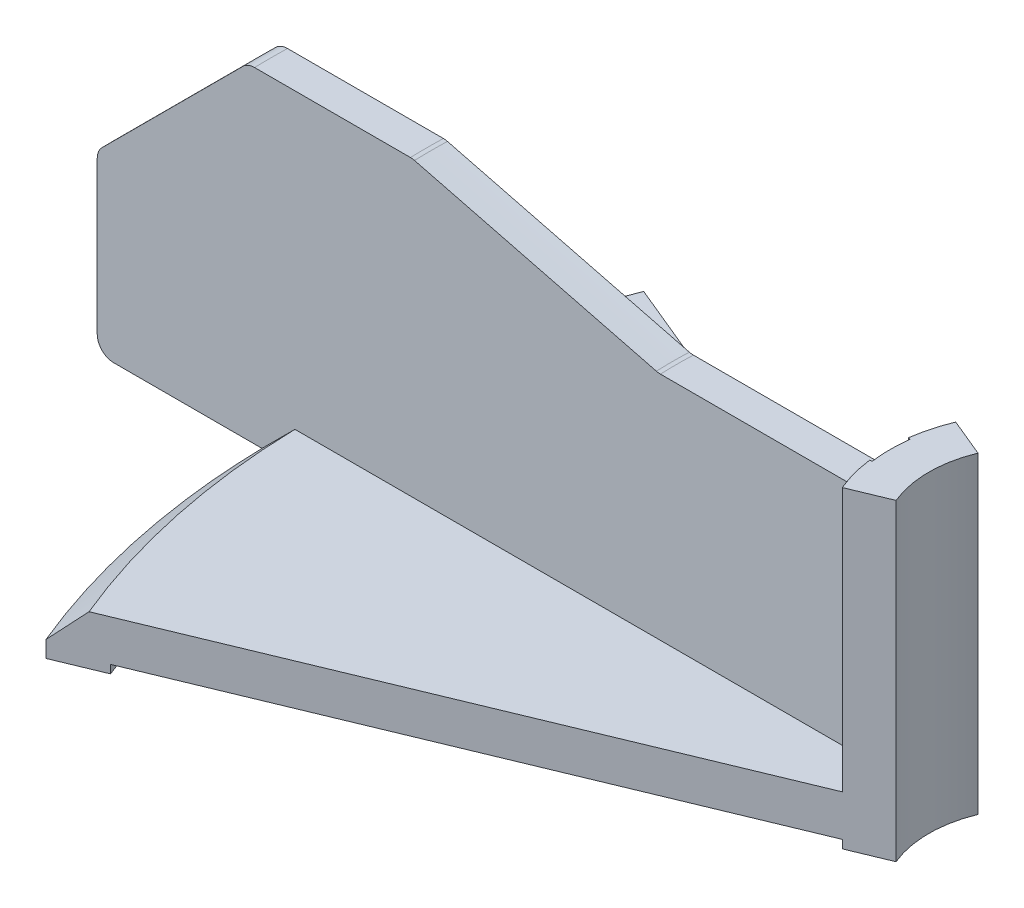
ISO-10303-21;
HEADER;
FILE_DESCRIPTION(('STEP AP214'),'2;1');
FILE_NAME('part.step','',(''),(''),'','','');
FILE_SCHEMA(('AUTOMOTIVE_DESIGN { 1 0 10303 214 1 1 1 1 }'));
ENDSEC;
DATA;
#1=APPLICATION_CONTEXT('core data for automotive mechanical design processes');
#2=APPLICATION_PROTOCOL_DEFINITION('international standard','automotive_design',2000,#1);
#3=PRODUCT_CONTEXT('',#1,'mechanical');
#4=PRODUCT('Part','Part','',(#3));
#5=PRODUCT_RELATED_PRODUCT_CATEGORY('part','',(#4));
#6=PRODUCT_DEFINITION_FORMATION('','',#4);
#7=PRODUCT_DEFINITION_CONTEXT('part definition',#1,'design');
#8=PRODUCT_DEFINITION('design','',#6,#7);
#9=PRODUCT_DEFINITION_SHAPE('','',#8);
#10=(LENGTH_UNIT() NAMED_UNIT(*) SI_UNIT(.MILLI.,.METRE.));
#11=(NAMED_UNIT(*) PLANE_ANGLE_UNIT() SI_UNIT($,.RADIAN.));
#12=(NAMED_UNIT(*) SI_UNIT($,.STERADIAN.) SOLID_ANGLE_UNIT());
#13=UNCERTAINTY_MEASURE_WITH_UNIT(LENGTH_MEASURE(1.E-05),#10,'distance_accuracy_value','');
#14=(GEOMETRIC_REPRESENTATION_CONTEXT(3) GLOBAL_UNCERTAINTY_ASSIGNED_CONTEXT((#13)) GLOBAL_UNIT_ASSIGNED_CONTEXT((#10,
#11,#12)) REPRESENTATION_CONTEXT('',''));
#15=CARTESIAN_POINT('',(0.,0.,0.));
#16=DIRECTION('',(0.,0.,1.));
#17=DIRECTION('',(1.,0.,0.));
#18=AXIS2_PLACEMENT_3D('',#15,#16,#17);
#19=CARTESIAN_POINT('',(0.,0.,0.));
#20=DIRECTION('',(0.382683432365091,0.,0.923879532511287));
#21=DIRECTION('',(0.923879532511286,0.,-0.382683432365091));
#22=AXIS2_PLACEMENT_3D('',#19,#20,#21);
#23=PLANE('',#22);
#24=DIRECTION('',(0.,1.,0.));
#25=VECTOR('',#24,1.);
#26=CARTESIAN_POINT('',(-42.4984584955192,23.,17.6034378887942));
#27=LINE('',#26,#25);
#28=CARTESIAN_POINT('',(-42.4984584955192,1.,17.6034378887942));
#29=VERTEX_POINT('',#28);
#30=CARTESIAN_POINT('',(-42.4984584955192,0.,17.6034378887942));
#31=VERTEX_POINT('',#30);
#32=EDGE_CURVE('E64',#29,#31,#27,.F.);
#33=ORIENTED_EDGE('',*,*,#32,.T.);
#34=DIRECTION('',(0.923879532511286,0.,-0.382683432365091));
#35=VECTOR('',#34,1.);
#36=CARTESIAN_POINT('',(39.2634559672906,0.,-16.2634559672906));
#37=LINE('',#36,#35);
#38=CARTESIAN_POINT('',(-39.7268198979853,0.,16.4553875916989));
#39=VERTEX_POINT('',#38);
#40=EDGE_CURVE('E347',#31,#39,#37,.T.);
#41=ORIENTED_EDGE('',*,*,#40,.T.);
#42=DIRECTION('',(0.,1.,0.));
#43=VECTOR('',#42,1.);
#44=CARTESIAN_POINT('',(-39.7268198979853,23.,16.4553875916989));
#45=LINE('',#44,#43);
#46=CARTESIAN_POINT('',(-39.7268198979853,0.5,16.4553875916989));
#47=VERTEX_POINT('',#46);
#48=EDGE_CURVE('E343',#39,#47,#45,.T.);
#49=ORIENTED_EDGE('',*,*,#48,.T.);
#50=DIRECTION('',(0.923879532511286,0.,-0.382683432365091));
#51=VECTOR('',#50,1.);
#52=CARTESIAN_POINT('',(7.68198051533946,0.5,-3.18198051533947));
#53=LINE('',#52,#51);
#54=CARTESIAN_POINT('',(-8.31491579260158,0.5,3.44415089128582));
#55=VERTEX_POINT('',#54);
#56=EDGE_CURVE('E333',#47,#55,#53,.T.);
#57=ORIENTED_EDGE('',*,*,#56,.T.);
#58=DIRECTION('',(0.,1.,0.));
#59=VECTOR('',#58,1.);
#60=CARTESIAN_POINT('',(-8.31491579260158,23.,3.44415089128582));
#61=LINE('',#60,#59);
#62=CARTESIAN_POINT('',(-8.31491579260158,0.,3.44415089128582));
#63=VERTEX_POINT('',#62);
#64=EDGE_CURVE('E326',#55,#63,#61,.F.);
#65=ORIENTED_EDGE('',*,*,#64,.T.);
#66=DIRECTION('',(0.923879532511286,0.,-0.382683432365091));
#67=VECTOR('',#66,1.);
#68=CARTESIAN_POINT('',(5.54809703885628,0.,-2.29809703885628));
#69=LINE('',#68,#67);
#70=CARTESIAN_POINT('',(-6.00521696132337,0.,2.48744231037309));
#71=VERTEX_POINT('',#70);
#72=EDGE_CURVE('E56',#63,#71,#69,.T.);
#73=ORIENTED_EDGE('',*,*,#72,.T.);
#74=DIRECTION('',(0.,1.,0.));
#75=VECTOR('',#74,1.);
#76=CARTESIAN_POINT('',(-6.00521696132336,23.,2.48744231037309));
#77=LINE('',#76,#75);
#78=CARTESIAN_POINT('',(-6.00521696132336,19.,2.48744231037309));
#79=VERTEX_POINT('',#78);
#80=EDGE_CURVE('E12',#71,#79,#77,.T.);
#81=ORIENTED_EDGE('',*,*,#80,.T.);
#82=DIRECTION('',(-0.923879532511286,0.,0.382683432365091));
#83=VECTOR('',#82,1.);
#84=CARTESIAN_POINT('',(7.68198051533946,19.,-3.18198051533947));
#85=LINE('',#84,#83);
#86=CARTESIAN_POINT('',(-8.31491579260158,19.,3.44415089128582));
#87=VERTEX_POINT('',#86);
#88=EDGE_CURVE('E319',#79,#87,#85,.T.);
#89=ORIENTED_EDGE('',*,*,#88,.T.);
#90=DIRECTION('',(0.,1.,0.));
#91=VECTOR('',#90,1.);
#92=CARTESIAN_POINT('',(-8.31491579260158,23.,3.44415089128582));
#93=LINE('',#92,#91);
#94=CARTESIAN_POINT('',(-8.31491579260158,3.,3.44415089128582));
#95=VERTEX_POINT('',#94);
#96=EDGE_CURVE('E335',#87,#95,#93,.F.);
#97=ORIENTED_EDGE('',*,*,#96,.T.);
#98=DIRECTION('',(-0.923879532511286,0.,0.382683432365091));
#99=VECTOR('',#98,1.);
#100=CARTESIAN_POINT('',(37.556349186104,3.,-15.5563491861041));
#101=LINE('',#100,#99);
#102=CARTESIAN_POINT('',(-40.6506994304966,3.,16.838071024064));
#103=VERTEX_POINT('',#102);
#104=EDGE_CURVE('E337',#95,#103,#101,.T.);
#105=ORIENTED_EDGE('',*,*,#104,.T.);
#106=DIRECTION('',(-0.653281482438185,-0.707106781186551,0.270598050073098));
#107=VECTOR('',#106,1.);
#108=CARTESIAN_POINT('',(0.,47.0000000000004,0.));
#109=LINE('',#108,#107);
#110=EDGE_CURVE('E340',#103,#29,#109,.T.);
#111=ORIENTED_EDGE('',*,*,#110,.T.);
#112=EDGE_LOOP('',(#33,#41,#49,#57,#65,#73,#81,#89,#97,#105,#111));
#113=FACE_BOUND('',#112,.T.);
#114=ADVANCED_FACE('F40',(#113),#23,.T.);
#115=CARTESIAN_POINT('',(0.,23.,0.));
#116=DIRECTION('',(0.,1.,0.));
#117=DIRECTION('',(0.,0.,1.));
#118=AXIS2_PLACEMENT_3D('',#115,#116,#117);
#119=CYLINDRICAL_SURFACE('',#118,9.);
#120=ORIENTED_EDGE('',*,*,#64,.F.);
#121=CARTESIAN_POINT('',(0.,0.5,0.));
#122=DIRECTION('',(0.,1.,0.));
#123=DIRECTION('',(0.,0.,1.));
#124=AXIS2_PLACEMENT_3D('',#121,#122,#123);
#125=CIRCLE('',#124,9.);
#126=CARTESIAN_POINT('',(-8.92291112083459,0.5,1.1754391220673));
#127=VERTEX_POINT('',#126);
#128=EDGE_CURVE('E789',#127,#55,#125,.T.);
#129=ORIENTED_EDGE('',*,*,#128,.F.);
#130=DIRECTION('',(0.,1.,0.));
#131=VECTOR('',#130,1.);
#132=CARTESIAN_POINT('',(-8.9229111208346,23.,1.1754391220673));
#133=LINE('',#132,#131);
#134=CARTESIAN_POINT('',(-8.9229111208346,0.,1.1754391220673));
#135=VERTEX_POINT('',#134);
#136=EDGE_CURVE('E442',#135,#127,#133,.T.);
#137=ORIENTED_EDGE('',*,*,#136,.F.);
#138=CARTESIAN_POINT('',(0.,0.,0.));
#139=DIRECTION('',(0.,1.,0.));
#140=DIRECTION('',(0.,0.,1.));
#141=AXIS2_PLACEMENT_3D('',#138,#139,#140);
#142=CIRCLE('',#141,9.);
#143=EDGE_CURVE('E792',#135,#63,#142,.T.);
#144=ORIENTED_EDGE('',*,*,#143,.T.);
#145=EDGE_LOOP('',(#120,#129,#137,#144));
#146=FACE_BOUND('',#145,.T.);
#147=ADVANCED_FACE('F677',(#146),#119,.T.);
#148=CARTESIAN_POINT('',(0.,23.,0.));
#149=DIRECTION('',(0.,1.,0.));
#150=DIRECTION('',(0.,0.,1.));
#151=AXIS2_PLACEMENT_3D('',#148,#149,#150);
#152=CYLINDRICAL_SURFACE('',#151,46.);
#153=ORIENTED_EDGE('',*,*,#32,.F.);
#154=CARTESIAN_POINT('',(0.,1.,0.));
#155=DIRECTION('',(0.,1.,0.));
#156=DIRECTION('',(0.,0.,1.));
#157=AXIS2_PLACEMENT_3D('',#154,#155,#156);
#158=CIRCLE('',#157,46.);
#159=CARTESIAN_POINT('',(-45.6063710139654,1.,6.00490823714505));
#160=VERTEX_POINT('',#159);
#161=EDGE_CURVE('E1188',#160,#29,#158,.T.);
#162=ORIENTED_EDGE('',*,*,#161,.F.);
#163=DIRECTION('',(0.,1.,0.));
#164=VECTOR('',#163,1.);
#165=CARTESIAN_POINT('',(-45.6063710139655,23.,6.00490823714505));
#166=LINE('',#165,#164);
#167=CARTESIAN_POINT('',(-45.6063710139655,0.,6.00490823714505));
#168=VERTEX_POINT('',#167);
#169=EDGE_CURVE('E440',#168,#160,#166,.T.);
#170=ORIENTED_EDGE('',*,*,#169,.F.);
#171=CARTESIAN_POINT('',(0.,0.,0.));
#172=DIRECTION('',(0.,1.,0.));
#173=DIRECTION('',(0.,0.,1.));
#174=AXIS2_PLACEMENT_3D('',#171,#172,#173);
#175=CIRCLE('',#174,46.);
#176=EDGE_CURVE('E778',#168,#31,#175,.T.);
#177=ORIENTED_EDGE('',*,*,#176,.T.);
#178=EDGE_LOOP('',(#153,#162,#170,#177));
#179=FACE_BOUND('',#178,.T.);
#180=ADVANCED_FACE('F682',(#179),#152,.T.);
#181=CARTESIAN_POINT('',(9.,19.,0.));
#182=DIRECTION('',(0.,-1.,0.));
#183=DIRECTION('',(0.,0.,-1.));
#184=AXIS2_PLACEMENT_3D('',#181,#182,#183);
#185=PLANE('',#184);
#186=ORIENTED_EDGE('',*,*,#88,.F.);
#187=CARTESIAN_POINT('',(0.,19.,0.));
#188=DIRECTION('',(0.,1.,0.));
#189=DIRECTION('',(0.,0.,1.));
#190=AXIS2_PLACEMENT_3D('',#187,#188,#189);
#191=CIRCLE('',#190,6.5);
#192=CARTESIAN_POINT('',(-6.00521696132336,19.,-2.48744231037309));
#193=VERTEX_POINT('',#192);
#194=EDGE_CURVE('E308',#193,#79,#191,.T.);
#195=ORIENTED_EDGE('',*,*,#194,.F.);
#196=DIRECTION('',(-0.923879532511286,0.,-0.382683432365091));
#197=VECTOR('',#196,1.);
#198=CARTESIAN_POINT('',(7.68198051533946,19.,3.18198051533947));
#199=LINE('',#198,#197);
#200=CARTESIAN_POINT('',(-8.31491579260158,19.,-3.44415089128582));
#201=VERTEX_POINT('',#200);
#202=EDGE_CURVE('E353',#193,#201,#199,.T.);
#203=ORIENTED_EDGE('',*,*,#202,.T.);
#204=CARTESIAN_POINT('',(0.,19.,0.));
#205=DIRECTION('',(0.,1.,0.));
#206=DIRECTION('',(0.,0.,1.));
#207=AXIS2_PLACEMENT_3D('',#204,#205,#206);
#208=CIRCLE('',#207,9.);
#209=CARTESIAN_POINT('',(-8.92300375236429,19.,-1.17473572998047));
#210=VERTEX_POINT('',#209);
#211=EDGE_CURVE('E1201',#201,#210,#208,.T.);
#212=ORIENTED_EDGE('',*,*,#211,.T.);
#213=DIRECTION('',(-0.99144486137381,0.,-0.130526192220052));
#214=VECTOR('',#213,1.);
#215=CARTESIAN_POINT('',(8.84666621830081,19.,1.16468570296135));
#216=LINE('',#215,#214);
#217=CARTESIAN_POINT('',(-8.78938531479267,19.,-1.15714452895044));
#218=VERTEX_POINT('',#217);
#219=EDGE_CURVE('E655',#218,#210,#216,.T.);
#220=ORIENTED_EDGE('',*,*,#219,.F.);
#221=CARTESIAN_POINT('',(0.,19.,0.));
#222=DIRECTION('',(0.,-1.,0.));
#223=DIRECTION('',(0.,0.,-1.));
#224=AXIS2_PLACEMENT_3D('',#221,#222,#223);
#225=CIRCLE('',#224,8.86522857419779);
#226=CARTESIAN_POINT('',(-8.78938531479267,19.,1.15714452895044));
#227=VERTEX_POINT('',#226);
#228=EDGE_CURVE('E733',#218,#227,#225,.F.);
#229=ORIENTED_EDGE('',*,*,#228,.T.);
#230=DIRECTION('',(-0.99144486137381,0.,0.130526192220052));
#231=VECTOR('',#230,1.);
#232=CARTESIAN_POINT('',(8.84666621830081,19.,-1.16468570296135));
#233=LINE('',#232,#231);
#234=CARTESIAN_POINT('',(-8.92300375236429,19.,1.17473572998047));
#235=VERTEX_POINT('',#234);
#236=EDGE_CURVE('E1228',#227,#235,#233,.T.);
#237=ORIENTED_EDGE('',*,*,#236,.T.);
#238=EDGE_CURVE('E323',#235,#87,#208,.T.);
#239=ORIENTED_EDGE('',*,*,#238,.T.);
#240=EDGE_LOOP('',(#186,#195,#203,#212,#220,#229,#237,#239));
#241=FACE_BOUND('',#240,.T.);
#242=ADVANCED_FACE('F320',(#241),#185,.F.);
#243=CARTESIAN_POINT('',(6.5,0.,0.));
#244=DIRECTION('',(0.,1.,0.));
#245=DIRECTION('',(0.,0.,1.));
#246=AXIS2_PLACEMENT_3D('',#243,#244,#245);
#247=PLANE('',#246);
#248=ORIENTED_EDGE('',*,*,#72,.F.);
#249=ORIENTED_EDGE('',*,*,#143,.F.);
#250=DIRECTION('',(-0.99144486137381,0.,0.130526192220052));
#251=VECTOR('',#250,1.);
#252=CARTESIAN_POINT('',(6.38935153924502,0.,-0.840458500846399));
#253=LINE('',#252,#251);
#254=CARTESIAN_POINT('',(-8.86770592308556,0.,1.16817121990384));
#255=VERTEX_POINT('',#254);
#256=EDGE_CURVE('E444',#255,#135,#253,.T.);
#257=ORIENTED_EDGE('',*,*,#256,.F.);
#258=CARTESIAN_POINT('',(0.0054354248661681,0.,0.));
#259=DIRECTION('',(0.,-1.,0.));
#260=DIRECTION('',(0.,0.,1.));
#261=AXIS2_PLACEMENT_3D('',#258,#259,#260);
#262=CIRCLE('',#261,8.94970733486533);
#263=CARTESIAN_POINT('',(-8.86770592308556,0.,-1.16817121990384));
#264=VERTEX_POINT('',#263);
#265=EDGE_CURVE('E399',#255,#264,#262,.T.);
#266=ORIENTED_EDGE('',*,*,#265,.T.);
#267=DIRECTION('',(-0.99144486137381,0.,-0.130526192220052));
#268=VECTOR('',#267,1.);
#269=CARTESIAN_POINT('',(6.38935153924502,0.,0.840458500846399));
#270=LINE('',#269,#268);
#271=CARTESIAN_POINT('',(-8.92291112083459,0.,-1.1754391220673));
#272=VERTEX_POINT('',#271);
#273=EDGE_CURVE('E432',#264,#272,#270,.T.);
#274=ORIENTED_EDGE('',*,*,#273,.T.);
#275=CARTESIAN_POINT('',(-8.31491579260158,0.,-3.44415089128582));
#276=VERTEX_POINT('',#275);
#277=EDGE_CURVE('E793',#276,#272,#142,.T.);
#278=ORIENTED_EDGE('',*,*,#277,.F.);
#279=DIRECTION('',(0.923879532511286,0.,0.382683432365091));
#280=VECTOR('',#279,1.);
#281=CARTESIAN_POINT('',(5.54809703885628,0.,2.29809703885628));
#282=LINE('',#281,#280);
#283=CARTESIAN_POINT('',(-6.00521696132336,0.,-2.48744231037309));
#284=VERTEX_POINT('',#283);
#285=EDGE_CURVE('E350',#276,#284,#282,.T.);
#286=ORIENTED_EDGE('',*,*,#285,.T.);
#287=CARTESIAN_POINT('',(0.,0.,0.));
#288=DIRECTION('',(0.,1.,0.));
#289=DIRECTION('',(0.,0.,1.));
#290=AXIS2_PLACEMENT_3D('',#287,#288,#289);
#291=CIRCLE('',#290,6.5);
#292=EDGE_CURVE('E315',#284,#71,#291,.T.);
#293=ORIENTED_EDGE('',*,*,#292,.T.);
#294=EDGE_LOOP('',(#248,#249,#257,#266,#274,#278,#286,#293));
#295=FACE_BOUND('',#294,.T.);
#296=ADVANCED_FACE('F843',(#295),#247,.F.);
#297=CARTESIAN_POINT('',(0.,23.,0.));
#298=DIRECTION('',(0.,1.,0.));
#299=DIRECTION('',(0.,0.,1.));
#300=AXIS2_PLACEMENT_3D('',#297,#298,#299);
#301=CYLINDRICAL_SURFACE('',#300,43.);
#302=ORIENTED_EDGE('',*,*,#48,.F.);
#303=CARTESIAN_POINT('',(0.,0.,0.));
#304=DIRECTION('',(0.,1.,0.));
#305=DIRECTION('',(0.,0.,1.));
#306=AXIS2_PLACEMENT_3D('',#303,#304,#305);
#307=CIRCLE('',#306,43.);
#308=CARTESIAN_POINT('',(-42.9883705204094,0.,1.));
#309=VERTEX_POINT('',#308);
#310=EDGE_CURVE('E777',#309,#39,#307,.T.);
#311=ORIENTED_EDGE('',*,*,#310,.F.);
#312=DIRECTION('',(0.,1.,0.));
#313=VECTOR('',#312,1.);
#314=CARTESIAN_POINT('',(-42.9883705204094,23.,1.));
#315=LINE('',#314,#313);
#316=CARTESIAN_POINT('',(-42.9883705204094,0.5,1.));
#317=VERTEX_POINT('',#316);
#318=EDGE_CURVE('E814',#317,#309,#315,.F.);
#319=ORIENTED_EDGE('',*,*,#318,.F.);
#320=CARTESIAN_POINT('',(0.,0.5,0.));
#321=DIRECTION('',(0.,1.,0.));
#322=DIRECTION('',(0.,0.,1.));
#323=AXIS2_PLACEMENT_3D('',#320,#321,#322);
#324=CIRCLE('',#323,43.);
#325=EDGE_CURVE('E786',#317,#47,#324,.T.);
#326=ORIENTED_EDGE('',*,*,#325,.T.);
#327=EDGE_LOOP('',(#302,#311,#319,#326));
#328=FACE_BOUND('',#327,.T.);
#329=ADVANCED_FACE('F832',(#328),#301,.F.);
#330=CARTESIAN_POINT('',(0.,1.,0.));
#331=DIRECTION('',(0.,-1.,0.));
#332=DIRECTION('',(0.,0.,-1.));
#333=AXIS2_PLACEMENT_3D('',#330,#331,#332);
#334=CONICAL_SURFACE('',#333,46.,0.785398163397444);
#335=ORIENTED_EDGE('',*,*,#110,.F.);
#336=CARTESIAN_POINT('',(0.,3.,0.));
#337=DIRECTION('',(0.,1.,0.));
#338=DIRECTION('',(0.,0.,1.));
#339=AXIS2_PLACEMENT_3D('',#336,#337,#338);
#340=CIRCLE('',#339,44.);
#341=CARTESIAN_POINT('',(-43.9886348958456,3.,1.));
#342=VERTEX_POINT('',#341);
#343=EDGE_CURVE('E1194',#342,#103,#340,.T.);
#344=ORIENTED_EDGE('',*,*,#343,.F.);
#345=CARTESIAN_POINT('',(-78.9509405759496,-31.9572733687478,1.));
#346=CARTESIAN_POINT('',(-75.9695447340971,-28.9761194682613,1.));
#347=CARTESIAN_POINT('',(-72.9881379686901,-25.9949764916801,1.));
#348=CARTESIAN_POINT('',(-67.025285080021,-20.0327301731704,1.));
#349=CARTESIAN_POINT('',(-64.0438389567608,-17.0516268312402,1.));
#350=CARTESIAN_POINT('',(-58.0808899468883,-11.0894776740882,1.));
#351=CARTESIAN_POINT('',(-55.0993870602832,-8.10843185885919,1.));
#352=CARTESIAN_POINT('',(-49.1362902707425,-2.14643099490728,1.));
#353=CARTESIAN_POINT('',(-46.1546963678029,0.834524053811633,1.));
#354=CARTESIAN_POINT('',(-41.6821841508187,5.3058360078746,1.));
#355=CARTESIAN_POINT('',(-40.1913263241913,6.79625341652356,1.));
#356=CARTESIAN_POINT('',(-37.2095537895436,9.77703128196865,1.));
#357=CARTESIAN_POINT('',(-35.7186390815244,11.2673917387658,1.));
#358=CARTESIAN_POINT('',(-32.7367283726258,14.2480309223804,1.));
#359=CARTESIAN_POINT('',(-31.2457323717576,15.738309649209,1.));
#360=CARTESIAN_POINT('',(-28.2636162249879,18.7187430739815,1.));
#361=CARTESIAN_POINT('',(-26.7724960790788,20.2088977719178,1.));
#362=CARTESIAN_POINT('',(-23.7900570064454,23.1890096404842,1.));
#363=CARTESIAN_POINT('',(-22.2987380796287,24.6789668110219,1.));
#364=CARTESIAN_POINT('',(-20.0614904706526,26.9136327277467,1.));
#365=CARTESIAN_POINT('',(-19.3156964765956,27.6584763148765,1.));
#366=CARTESIAN_POINT('',(-17.8239802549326,29.1480351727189,1.));
#367=CARTESIAN_POINT('',(-17.0780580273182,29.8927504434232,1.));
#368=CARTESIAN_POINT('',(-15.5860256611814,31.3819938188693,1.));
#369=CARTESIAN_POINT('',(-14.839915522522,32.1265219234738,1.));
#370=CARTESIAN_POINT('',(-13.3474078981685,33.6152898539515,1.));
#371=CARTESIAN_POINT('',(-12.6010104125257,34.3595296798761,1.));
#372=CARTESIAN_POINT('',(-11.4810498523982,35.4755244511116,1.));
#373=CARTESIAN_POINT('',(-11.107668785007,35.847462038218,1.));
#374=CARTESIAN_POINT('',(-10.3607402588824,36.5911700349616,1.));
#375=CARTESIAN_POINT('',(-9.98719280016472,36.9629404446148,1.));
#376=CARTESIAN_POINT('',(-9.23987194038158,37.7062546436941,1.));
#377=CARTESIAN_POINT('',(-8.86609853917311,38.0777984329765,1.));
#378=CARTESIAN_POINT('',(-8.11821028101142,38.8205424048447,1.));
#379=CARTESIAN_POINT('',(-7.74409542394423,39.1917425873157,1.));
#380=CARTESIAN_POINT('',(-7.36975208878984,39.5627124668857,1.));
#381=B_SPLINE_CURVE_WITH_KNOTS('',3,(#345,#346,#347,#348,#349,#350,#351,#352,#353,#354,#355,
#356,#357,#358,#359,#360,#361,#362,#363,#364,#365,#366,#367,#368,#369,#370,#371,#372,#373,#374,
#375,#376,#377,#378,#379,#380),.UNSPECIFIED.,.F.,.F.,(4,2,2,2,2,2,2,2,2,2,2,2,2,2,2,2,2,4),(0.,
12.6484780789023,25.2969555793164,37.945431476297,50.5939079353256,56.9181478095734,
63.242387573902,69.5666264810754,75.8908657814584,82.2151080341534,85.3772284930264,
88.5393491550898,91.7014721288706,94.8635945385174,96.4446570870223,98.02571948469,
99.606782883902,101.187846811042),.UNSPECIFIED.);
#382=CARTESIAN_POINT('',(-45.9891291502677,1.,1.));
#383=VERTEX_POINT('',#382);
#384=EDGE_CURVE('E819',#383,#342,#381,.T.);
#385=ORIENTED_EDGE('',*,*,#384,.F.);
#386=EDGE_CURVE('E1234',#383,#160,#158,.T.);
#387=ORIENTED_EDGE('',*,*,#386,.T.);
#388=ORIENTED_EDGE('',*,*,#161,.T.);
#389=EDGE_LOOP('',(#335,#344,#385,#387,#388));
#390=FACE_BOUND('',#389,.T.);
#391=ADVANCED_FACE('F827',(#390),#334,.T.);
#392=CARTESIAN_POINT('',(44.,3.,0.));
#393=DIRECTION('',(0.,-1.,0.));
#394=DIRECTION('',(0.,0.,-1.));
#395=AXIS2_PLACEMENT_3D('',#392,#393,#394);
#396=PLANE('',#395);
#397=ORIENTED_EDGE('',*,*,#104,.F.);
#398=CARTESIAN_POINT('',(0.,3.,0.));
#399=DIRECTION('',(0.,1.,0.));
#400=DIRECTION('',(0.,0.,1.));
#401=AXIS2_PLACEMENT_3D('',#398,#399,#400);
#402=CIRCLE('',#401,9.);
#403=CARTESIAN_POINT('',(-8.94427190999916,3.,1.));
#404=VERTEX_POINT('',#403);
#405=EDGE_CURVE('E1198',#404,#95,#402,.T.);
#406=ORIENTED_EDGE('',*,*,#405,.F.);
#407=DIRECTION('',(1.,0.,0.));
#408=VECTOR('',#407,1.);
#409=CARTESIAN_POINT('',(44.,3.,1.));
#410=LINE('',#409,#408);
#411=EDGE_CURVE('E825',#342,#404,#410,.T.);
#412=ORIENTED_EDGE('',*,*,#411,.F.);
#413=ORIENTED_EDGE('',*,*,#343,.T.);
#414=EDGE_LOOP('',(#397,#406,#412,#413));
#415=FACE_BOUND('',#414,.T.);
#416=ADVANCED_FACE('F831',(#415),#396,.F.);
#417=CARTESIAN_POINT('',(0.,23.,0.));
#418=DIRECTION('',(0.,1.,0.));
#419=DIRECTION('',(0.,0.,1.));
#420=AXIS2_PLACEMENT_3D('',#417,#418,#419);
#421=CYLINDRICAL_SURFACE('',#420,9.);
#422=ORIENTED_EDGE('',*,*,#96,.F.);
#423=ORIENTED_EDGE('',*,*,#238,.F.);
#424=DIRECTION('',(0.,1.,0.));
#425=VECTOR('',#424,1.);
#426=CARTESIAN_POINT('',(-8.92300375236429,23.,1.17473572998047));
#427=LINE('',#426,#425);
#428=CARTESIAN_POINT('',(-8.92300375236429,17.,1.17473572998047));
#429=VERTEX_POINT('',#428);
#430=EDGE_CURVE('E745',#235,#429,#427,.F.);
#431=ORIENTED_EDGE('',*,*,#430,.T.);
#432=CARTESIAN_POINT('',(0.,17.,0.));
#433=DIRECTION('',(0.,-1.,0.));
#434=DIRECTION('',(0.,0.,-1.));
#435=AXIS2_PLACEMENT_3D('',#432,#433,#434);
#436=CIRCLE('',#435,9.);
#437=CARTESIAN_POINT('',(-8.94427190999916,17.,1.));
#438=VERTEX_POINT('',#437);
#439=EDGE_CURVE('E1238',#429,#438,#436,.T.);
#440=ORIENTED_EDGE('',*,*,#439,.T.);
#441=DIRECTION('',(0.,1.,0.));
#442=VECTOR('',#441,1.);
#443=CARTESIAN_POINT('',(-8.94427190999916,23.,1.));
#444=LINE('',#443,#442);
#445=EDGE_CURVE('E314',#404,#438,#444,.T.);
#446=ORIENTED_EDGE('',*,*,#445,.F.);
#447=ORIENTED_EDGE('',*,*,#405,.T.);
#448=EDGE_LOOP('',(#422,#423,#431,#440,#446,#447));
#449=FACE_BOUND('',#448,.T.);
#450=ADVANCED_FACE('F523',(#449),#421,.T.);
#451=CARTESIAN_POINT('',(9.,0.5,0.));
#452=DIRECTION('',(0.,1.,0.));
#453=DIRECTION('',(0.,0.,1.));
#454=AXIS2_PLACEMENT_3D('',#451,#452,#453);
#455=PLANE('',#454);
#456=ORIENTED_EDGE('',*,*,#56,.F.);
#457=ORIENTED_EDGE('',*,*,#325,.F.);
#458=DIRECTION('',(-1.,0.,0.));
#459=VECTOR('',#458,1.);
#460=CARTESIAN_POINT('',(9.,0.5,1.));
#461=LINE('',#460,#459);
#462=CARTESIAN_POINT('',(-42.9767393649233,0.5,1.));
#463=VERTEX_POINT('',#462);
#464=EDGE_CURVE('E812',#463,#317,#461,.T.);
#465=ORIENTED_EDGE('',*,*,#464,.F.);
#466=CARTESIAN_POINT('',(0.0054354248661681,0.5,0.));
#467=DIRECTION('',(0.,-1.,0.));
#468=DIRECTION('',(0.,0.,1.));
#469=AXIS2_PLACEMENT_3D('',#466,#467,#468);
#470=CIRCLE('',#469,42.9938059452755);
#471=CARTESIAN_POINT('',(-42.9767393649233,0.5,-1.));
#472=VERTEX_POINT('',#471);
#473=EDGE_CURVE('E404',#463,#472,#470,.T.);
#474=ORIENTED_EDGE('',*,*,#473,.T.);
#475=DIRECTION('',(1.,0.,0.));
#476=VECTOR('',#475,1.);
#477=CARTESIAN_POINT('',(9.,0.5,-1.));
#478=LINE('',#477,#476);
#479=CARTESIAN_POINT('',(-42.9883705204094,0.5,-1.));
#480=VERTEX_POINT('',#479);
#481=EDGE_CURVE('E1203',#480,#472,#478,.T.);
#482=ORIENTED_EDGE('',*,*,#481,.F.);
#483=CARTESIAN_POINT('',(-39.7268198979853,0.5,-16.4553875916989));
#484=VERTEX_POINT('',#483);
#485=EDGE_CURVE('E787',#484,#480,#324,.T.);
#486=ORIENTED_EDGE('',*,*,#485,.F.);
#487=DIRECTION('',(0.923879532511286,0.,0.382683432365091));
#488=VECTOR('',#487,1.);
#489=CARTESIAN_POINT('',(7.68198051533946,0.5,3.18198051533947));
#490=LINE('',#489,#488);
#491=CARTESIAN_POINT('',(-8.31491579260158,0.5,-3.44415089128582));
#492=VERTEX_POINT('',#491);
#493=EDGE_CURVE('E358',#484,#492,#490,.T.);
#494=ORIENTED_EDGE('',*,*,#493,.T.);
#495=CARTESIAN_POINT('',(-8.92291112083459,0.5,-1.1754391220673));
#496=VERTEX_POINT('',#495);
#497=EDGE_CURVE('E790',#492,#496,#125,.T.);
#498=ORIENTED_EDGE('',*,*,#497,.T.);
#499=DIRECTION('',(0.99144486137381,0.,0.130526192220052));
#500=VECTOR('',#499,1.);
#501=CARTESIAN_POINT('',(-42.62055255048,0.5,-5.61181777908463));
#502=LINE('',#501,#500);
#503=CARTESIAN_POINT('',(-8.86770592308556,0.5,-1.16817121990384));
#504=VERTEX_POINT('',#503);
#505=EDGE_CURVE('E384',#496,#504,#502,.T.);
#506=ORIENTED_EDGE('',*,*,#505,.T.);
#507=CARTESIAN_POINT('',(0.0054354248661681,0.5,0.));
#508=DIRECTION('',(0.,-1.,0.));
#509=DIRECTION('',(0.,0.,1.));
#510=AXIS2_PLACEMENT_3D('',#507,#508,#509);
#511=CIRCLE('',#510,8.94970733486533);
#512=CARTESIAN_POINT('',(-8.86770592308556,0.5,1.16817121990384));
#513=VERTEX_POINT('',#512);
#514=EDGE_CURVE('E401',#513,#504,#511,.T.);
#515=ORIENTED_EDGE('',*,*,#514,.F.);
#516=DIRECTION('',(0.99144486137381,0.,-0.130526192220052));
#517=VECTOR('',#516,1.);
#518=CARTESIAN_POINT('',(-42.62055255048,0.5,5.61181777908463));
#519=LINE('',#518,#517);
#520=EDGE_CURVE('E394',#127,#513,#519,.T.);
#521=ORIENTED_EDGE('',*,*,#520,.F.);
#522=ORIENTED_EDGE('',*,*,#128,.T.);
#523=EDGE_LOOP('',(#456,#457,#465,#474,#482,#486,#494,#498,#506,#515,#521,#522));
#524=FACE_BOUND('',#523,.T.);
#525=ADVANCED_FACE('F840',(#524),#455,.F.);
#526=CARTESIAN_POINT('',(46.,0.,0.));
#527=DIRECTION('',(0.,1.,0.));
#528=DIRECTION('',(0.,0.,1.));
#529=AXIS2_PLACEMENT_3D('',#526,#527,#528);
#530=PLANE('',#529);
#531=ORIENTED_EDGE('',*,*,#40,.F.);
#532=ORIENTED_EDGE('',*,*,#176,.F.);
#533=DIRECTION('',(-0.99144486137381,0.,0.130526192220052));
#534=VECTOR('',#533,1.);
#535=CARTESIAN_POINT('',(45.2163866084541,0.,-5.95213464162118));
#536=LINE('',#535,#534);
#537=CARTESIAN_POINT('',(-45.5956392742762,0.,6.0034953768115));
#538=VERTEX_POINT('',#537);
#539=EDGE_CURVE('E438',#538,#168,#536,.T.);
#540=ORIENTED_EDGE('',*,*,#539,.F.);
#541=CARTESIAN_POINT('',(0.0054354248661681,0.,0.));
#542=DIRECTION('',(0.,-1.,0.));
#543=DIRECTION('',(0.,0.,1.));
#544=AXIS2_PLACEMENT_3D('',#541,#542,#543);
#545=CIRCLE('',#544,45.9945645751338);
#546=CARTESIAN_POINT('',(-45.5956392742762,0.,-6.0034953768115));
#547=VERTEX_POINT('',#546);
#548=EDGE_CURVE('E410',#538,#547,#545,.T.);
#549=ORIENTED_EDGE('',*,*,#548,.T.);
#550=DIRECTION('',(-0.99144486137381,0.,-0.130526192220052));
#551=VECTOR('',#550,1.);
#552=CARTESIAN_POINT('',(45.2163866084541,0.,5.95213464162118));
#553=LINE('',#552,#551);
#554=CARTESIAN_POINT('',(-45.6063710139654,0.,-6.00490823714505));
#555=VERTEX_POINT('',#554);
#556=EDGE_CURVE('E635',#547,#555,#553,.T.);
#557=ORIENTED_EDGE('',*,*,#556,.T.);
#558=CARTESIAN_POINT('',(-42.4984584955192,0.,-17.6034378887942));
#559=VERTEX_POINT('',#558);
#560=EDGE_CURVE('E761',#559,#555,#175,.T.);
#561=ORIENTED_EDGE('',*,*,#560,.F.);
#562=DIRECTION('',(0.923879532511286,0.,0.382683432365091));
#563=VECTOR('',#562,1.);
#564=CARTESIAN_POINT('',(39.2634559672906,0.,16.2634559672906));
#565=LINE('',#564,#563);
#566=CARTESIAN_POINT('',(-39.7268198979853,0.,-16.4553875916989));
#567=VERTEX_POINT('',#566);
#568=EDGE_CURVE('E376',#559,#567,#565,.T.);
#569=ORIENTED_EDGE('',*,*,#568,.T.);
#570=CARTESIAN_POINT('',(-42.9883705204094,0.,-1.));
#571=VERTEX_POINT('',#570);
#572=EDGE_CURVE('E781',#567,#571,#307,.T.);
#573=ORIENTED_EDGE('',*,*,#572,.T.);
#574=DIRECTION('',(-1.,0.,0.));
#575=VECTOR('',#574,1.);
#576=CARTESIAN_POINT('',(-8.86522857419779,0.,-1.));
#577=LINE('',#576,#575);
#578=CARTESIAN_POINT('',(-42.9767393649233,0.,-1.));
#579=VERTEX_POINT('',#578);
#580=EDGE_CURVE('E426',#579,#571,#577,.T.);
#581=ORIENTED_EDGE('',*,*,#580,.F.);
#582=CARTESIAN_POINT('',(0.0054354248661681,0.,0.));
#583=DIRECTION('',(0.,-1.,0.));
#584=DIRECTION('',(0.,0.,1.));
#585=AXIS2_PLACEMENT_3D('',#582,#583,#584);
#586=CIRCLE('',#585,42.9938059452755);
#587=CARTESIAN_POINT('',(-42.9767393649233,0.,1.));
#588=VERTEX_POINT('',#587);
#589=EDGE_CURVE('E407',#588,#579,#586,.T.);
#590=ORIENTED_EDGE('',*,*,#589,.F.);
#591=DIRECTION('',(1.,0.,0.));
#592=VECTOR('',#591,1.);
#593=CARTESIAN_POINT('',(-8.86522857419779,0.,1.));
#594=LINE('',#593,#592);
#595=EDGE_CURVE('E754',#309,#588,#594,.T.);
#596=ORIENTED_EDGE('',*,*,#595,.F.);
#597=ORIENTED_EDGE('',*,*,#310,.T.);
#598=EDGE_LOOP('',(#531,#532,#540,#549,#557,#561,#569,#573,#581,#590,#596,#597));
#599=FACE_BOUND('',#598,.T.);
#600=ADVANCED_FACE('F760',(#599),#530,.F.);
#601=CARTESIAN_POINT('',(0.,23.,0.));
#602=DIRECTION('',(0.,1.,0.));
#603=DIRECTION('',(0.,0.,1.));
#604=AXIS2_PLACEMENT_3D('',#601,#602,#603);
#605=CYLINDRICAL_SURFACE('',#604,6.5);
#606=ORIENTED_EDGE('',*,*,#80,.F.);
#607=ORIENTED_EDGE('',*,*,#292,.F.);
#608=DIRECTION('',(0.,1.,0.));
#609=VECTOR('',#608,1.);
#610=CARTESIAN_POINT('',(-6.00521696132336,23.,-2.48744231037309));
#611=LINE('',#610,#609);
#612=EDGE_CURVE('E49',#284,#193,#611,.T.);
#613=ORIENTED_EDGE('',*,*,#612,.T.);
#614=ORIENTED_EDGE('',*,*,#194,.T.);
#615=EDGE_LOOP('',(#606,#607,#613,#614));
#616=FACE_BOUND('',#615,.T.);
#617=ADVANCED_FACE('F310',(#616),#605,.F.);
#618=CARTESIAN_POINT('',(-8.86522857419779,23.,-1.));
#619=DIRECTION('',(0.,0.,1.));
#620=DIRECTION('',(1.,0.,0.));
#621=AXIS2_PLACEMENT_3D('',#618,#619,#620);
#622=PLANE('',#621);
#623=DIRECTION('',(1.,0.,0.));
#624=VECTOR('',#623,1.);
#625=CARTESIAN_POINT('',(-8.86522857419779,20.8,-1.));
#626=LINE('',#625,#624);
#627=CARTESIAN_POINT('',(-46.4402497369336,20.8,-1.));
#628=VERTEX_POINT('',#627);
#629=CARTESIAN_POINT('',(-36.9770464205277,20.8,-1.));
#630=VERTEX_POINT('',#629);
#631=EDGE_CURVE('E511',#628,#630,#626,.T.);
#632=ORIENTED_EDGE('',*,*,#631,.T.);
#633=CARTESIAN_POINT('',(-36.9770464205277,20.8,-1.));
#634=CARTESIAN_POINT('',(-36.9352549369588,20.7999799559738,-1.));
#635=CARTESIAN_POINT('',(-36.8937851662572,20.7973921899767,-1.));
#636=CARTESIAN_POINT('',(-36.8114890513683,20.787081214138,-1.));
#637=CARTESIAN_POINT('',(-36.7706627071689,20.7793580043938,-1.));
#638=CARTESIAN_POINT('',(-36.7301580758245,20.769067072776,-1.));
#639=B_SPLINE_CURVE_WITH_KNOTS('',3,(#633,#634,#635,#636,#637,#638),.UNSPECIFIED.,.F.,.F.,(4,2,
4),(0.,0.124651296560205,0.249302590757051),.UNSPECIFIED.);
#640=CARTESIAN_POINT('',(-36.7301580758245,20.769067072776,-1.));
#641=VERTEX_POINT('',#640);
#642=EDGE_CURVE('E559',#630,#641,#639,.T.);
#643=ORIENTED_EDGE('',*,*,#642,.T.);
#644=CARTESIAN_POINT('',(-63.213126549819,27.5121746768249,-1.));
#645=CARTESIAN_POINT('',(-60.8317569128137,26.9057752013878,-1.));
#646=CARTESIAN_POINT('',(-58.4503855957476,26.2993823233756,-1.));
#647=CARTESIAN_POINT('',(-53.6876370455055,25.0866200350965,-1.));
#648=CARTESIAN_POINT('',(-51.3062598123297,24.4802506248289,-1.));
#649=CARTESIAN_POINT('',(-46.5434969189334,23.2675455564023,-1.));
#650=CARTESIAN_POINT('',(-44.1621112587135,22.6612098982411,-1.));
#651=CARTESIAN_POINT('',(-39.399325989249,21.4485931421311,-1.));
#652=CARTESIAN_POINT('',(-37.0179263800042,20.8423120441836,-1.));
#653=CARTESIAN_POINT('',(-32.2551032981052,19.6298422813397,-1.));
#654=CARTESIAN_POINT('',(-29.8736798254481,19.0236536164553,-1.));
#655=CARTESIAN_POINT('',(-26.301508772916,18.1145118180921,-1.));
#656=CARTESIAN_POINT('',(-25.1107791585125,17.8114880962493,-1.));
#657=CARTESIAN_POINT('',(-22.729301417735,17.2055132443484,-1.));
#658=CARTESIAN_POINT('',(-21.5385532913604,16.9025621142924,-1.));
#659=CARTESIAN_POINT('',(-19.1570268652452,16.2967772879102,-1.));
#660=CARTESIAN_POINT('',(-17.9662485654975,15.9939435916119,-1.));
#661=CARTESIAN_POINT('',(-15.5846406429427,15.3884784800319,-1.));
#662=CARTESIAN_POINT('',(-14.3938110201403,15.0858470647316,-1.));
#663=CARTESIAN_POINT('',(-12.6074862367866,14.6322153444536,-1.));
#664=CARTESIAN_POINT('',(-12.0120311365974,14.4810573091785,-1.));
#665=CARTESIAN_POINT('',(-10.8210788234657,14.1789074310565,-1.));
#666=CARTESIAN_POINT('',(-10.2255816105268,14.0279155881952,-1.));
#667=CARTESIAN_POINT('',(-9.03451857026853,13.7262016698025,-1.));
#668=CARTESIAN_POINT('',(-8.43895274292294,13.5754795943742,-1.));
#669=CARTESIAN_POINT('',(-7.54550980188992,13.3497688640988,-1.));
#670=CARTESIAN_POINT('',(-7.24767974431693,13.2745940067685,-1.));
#671=CARTESIAN_POINT('',(-6.65197243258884,13.1244313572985,-1.));
#672=CARTESIAN_POINT('',(-6.35409517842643,13.049443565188,-1.));
#673=CARTESIAN_POINT('',(-6.05618645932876,12.9745807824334,-1.));
#674=B_SPLINE_CURVE_WITH_KNOTS('',3,(#644,#645,#646,#647,#648,#649,#650,#651,#652,#653,#654,
#655,#656,#657,#658,#659,#660,#661,#662,#663,#664,#665,#666,#667,#668,#669,#670,#671,#672,#673),
.UNSPECIFIED.,.F.,.F.,(4,2,2,2,2,2,2,2,2,2,2,2,2,2,4),(0.,7.37209434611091,14.7441885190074,
22.1162822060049,29.4883760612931,36.860470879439,40.5465180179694,44.2325652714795,
47.9186134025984,51.6046611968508,53.4476858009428,55.2907102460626,57.1337353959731,
58.0552482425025,58.9767612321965),.UNSPECIFIED.);
#675=CARTESIAN_POINT('',(-22.0430609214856,17.030932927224,-1.));
#676=VERTEX_POINT('',#675);
#677=EDGE_CURVE('E504',#641,#676,#674,.T.);
#678=ORIENTED_EDGE('',*,*,#677,.T.);
#679=CARTESIAN_POINT('',(-22.0430609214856,17.030932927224,-1.));
#680=CARTESIAN_POINT('',(-22.0025282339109,17.0206418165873,-1.));
#681=CARTESIAN_POINT('',(-21.9616740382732,17.0129185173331,-1.));
#682=CARTESIAN_POINT('',(-21.879322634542,17.0026075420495,-1.));
#683=CARTESIAN_POINT('',(-21.8378254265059,17.0000198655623,-1.));
#684=CARTESIAN_POINT('',(-21.7960067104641,17.,-1.));
#685=B_SPLINE_CURVE_WITH_KNOTS('',3,(#679,#680,#681,#682,#683,#684),.UNSPECIFIED.,.F.,.F.,(4,2,
4),(0.,0.124733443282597,0.249466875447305),.UNSPECIFIED.);
#686=CARTESIAN_POINT('',(-21.7960067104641,17.,-1.));
#687=VERTEX_POINT('',#686);
#688=EDGE_CURVE('E604',#676,#687,#685,.T.);
#689=ORIENTED_EDGE('',*,*,#688,.T.);
#690=DIRECTION('',(1.,0.,0.));
#691=VECTOR('',#690,1.);
#692=CARTESIAN_POINT('',(-8.86522857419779,17.,-1.));
#693=LINE('',#692,#691);
#694=CARTESIAN_POINT('',(-8.94427190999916,17.,-1.));
#695=VERTEX_POINT('',#694);
#696=EDGE_CURVE('E804',#687,#695,#693,.T.);
#697=ORIENTED_EDGE('',*,*,#696,.T.);
#698=DIRECTION('',(0.,1.,0.));
#699=VECTOR('',#698,1.);
#700=CARTESIAN_POINT('',(-8.94427190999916,23.,-1.));
#701=LINE('',#700,#699);
#702=CARTESIAN_POINT('',(-8.94427190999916,3.,-1.));
#703=VERTEX_POINT('',#702);
#704=EDGE_CURVE('E797',#695,#703,#701,.F.);
#705=ORIENTED_EDGE('',*,*,#704,.T.);
#706=DIRECTION('',(-1.,0.,0.));
#707=VECTOR('',#706,1.);
#708=CARTESIAN_POINT('',(44.,3.,-1.));
#709=LINE('',#708,#707);
#710=CARTESIAN_POINT('',(-43.9886348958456,3.,-1.));
#711=VERTEX_POINT('',#710);
#712=EDGE_CURVE('E803',#703,#711,#709,.T.);
#713=ORIENTED_EDGE('',*,*,#712,.T.);
#714=CARTESIAN_POINT('',(-7.36975208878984,39.5627124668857,-1.));
#715=CARTESIAN_POINT('',(-7.62763684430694,39.3071631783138,-1.));
#716=CARTESIAN_POINT('',(-7.88540700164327,39.0514983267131,-1.));
#717=CARTESIAN_POINT('',(-8.40076530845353,38.5399853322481,-1.));
#718=CARTESIAN_POINT('',(-8.65835345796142,38.284137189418,-1.));
#719=CARTESIAN_POINT('',(-9.43091555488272,37.5163896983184,-1.));
#720=CARTESIAN_POINT('',(-9.94568741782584,37.0042870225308,-1.));
#721=CARTESIAN_POINT('',(-10.9748967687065,35.9797466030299,-1.));
#722=CARTESIAN_POINT('',(-11.4893342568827,35.4673088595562,-1.));
#723=CARTESIAN_POINT('',(-12.5179848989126,34.4422081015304,-1.));
#724=CARTESIAN_POINT('',(-13.0321980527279,33.9295450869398,-1.));
#725=CARTESIAN_POINT('',(-14.5746054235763,32.3913276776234,-1.));
#726=CARTESIAN_POINT('',(-15.6025697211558,31.3655427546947,-1.));
#727=CARTESIAN_POINT('',(-17.6581684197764,29.313642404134,-1.));
#728=CARTESIAN_POINT('',(-18.6858028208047,28.2875269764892,-1.));
#729=CARTESIAN_POINT('',(-21.7684121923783,25.2088864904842,-1.));
#730=CARTESIAN_POINT('',(-23.8230933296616,23.1560672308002,-1.));
#731=CARTESIAN_POINT('',(-27.9321202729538,19.050090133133,-1.));
#732=CARTESIAN_POINT('',(-29.9864660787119,16.9969322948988,-1.));
#733=CARTESIAN_POINT('',(-34.0949699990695,12.8904289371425,-1.));
#734=CARTESIAN_POINT('',(-36.1491281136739,10.8370834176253,-1.));
#735=CARTESIAN_POINT('',(-39.0315460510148,7.95565169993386,-1.));
#736=CARTESIAN_POINT('',(-39.8598518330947,7.12761147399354,-1.));
#737=CARTESIAN_POINT('',(-41.516447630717,5.47151559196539,-1.));
#738=CARTESIAN_POINT('',(-42.3447376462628,4.64345993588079,-1.));
#739=CARTESIAN_POINT('',(-49.1363697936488,-2.14634644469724,-1.));
#740=CARTESIAN_POINT('',(-55.0994147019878,-8.10839446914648,-1.));
#741=CARTESIAN_POINT('',(-64.0438311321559,-17.0516229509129,-1.));
#742=CARTESIAN_POINT('',(-67.0252794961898,-20.0327265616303,-1.));
#743=CARTESIAN_POINT('',(-72.9881367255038,-25.9949732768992,-1.));
#744=CARTESIAN_POINT('',(-75.9695455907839,-28.9761163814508,-1.));
#745=CARTESIAN_POINT('',(-78.9509405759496,-31.9572733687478,-1.));
#746=B_SPLINE_CURVE_WITH_KNOTS('',3,(#714,#715,#716,#717,#718,#719,#720,#721,#722,#723,#724,
#725,#726,#727,#728,#729,#730,#731,#732,#733,#734,#735,#736,#737,#738,#739,#740,#741,#742,#743,
#744,#745),.UNSPECIFIED.,.F.,.F.,(4,2,2,2,2,2,2,2,2,2,2,2,2,2,2,4),(0.,1.08916922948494,
2.17833825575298,4.35667517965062,6.53501054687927,8.71334628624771,13.0700085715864,
17.4266710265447,26.139995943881,34.853327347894,43.5666585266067,47.0802990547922,
50.5939388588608,75.8908811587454,88.5393639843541,101.187846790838),.UNSPECIFIED.);
#747=CARTESIAN_POINT('',(-45.9891291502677,1.,-1.));
#748=VERTEX_POINT('',#747);
#749=EDGE_CURVE('E528',#711,#748,#746,.T.);
#750=ORIENTED_EDGE('',*,*,#749,.T.);
#751=DIRECTION('',(-1.,0.,0.));
#752=VECTOR('',#751,1.);
#753=CARTESIAN_POINT('',(-8.86522857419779,1.,-1.));
#754=LINE('',#753,#752);
#755=CARTESIAN_POINT('',(-54.9909083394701,1.,-1.));
#756=VERTEX_POINT('',#755);
#757=EDGE_CURVE('E417',#748,#756,#754,.T.);
#758=ORIENTED_EDGE('',*,*,#757,.T.);
#759=CARTESIAN_POINT('',(-54.9909083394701,1.,-1.));
#760=CARTESIAN_POINT('',(-55.0190510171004,1.00000018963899,-1.));
#761=CARTESIAN_POINT('',(-55.0471802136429,1.0011883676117,-1.));
#762=CARTESIAN_POINT('',(-55.1032373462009,1.00592851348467,-1.));
#763=CARTESIAN_POINT('',(-55.1311652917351,1.00948036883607,-1.));
#764=CARTESIAN_POINT('',(-55.214298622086,1.02364779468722,-1.));
#765=CARTESIAN_POINT('',(-55.2689471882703,1.03777531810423,-1.));
#766=CARTESIAN_POINT('',(-55.3750953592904,1.07500423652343,-1.));
#767=CARTESIAN_POINT('',(-55.4265934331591,1.09810995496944,-1.));
#768=CARTESIAN_POINT('',(-55.5249775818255,1.15263743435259,-1.));
#769=CARTESIAN_POINT('',(-55.5718644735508,1.18405771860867,-1.));
#770=CARTESIAN_POINT('',(-55.6596915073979,1.25432062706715,-1.));
#771=CARTESIAN_POINT('',(-55.7006321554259,1.2931626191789,-1.));
#772=CARTESIAN_POINT('',(-55.7754188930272,1.37717883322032,-1.));
#773=CARTESIAN_POINT('',(-55.8092635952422,1.42235429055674,-1.));
#774=CARTESIAN_POINT('',(-55.8688860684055,1.51774419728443,-1.));
#775=CARTESIAN_POINT('',(-55.8946635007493,1.56795885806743,-1.));
#776=CARTESIAN_POINT('',(-55.9374074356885,1.67199365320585,-1.));
#777=CARTESIAN_POINT('',(-55.9543791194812,1.72581164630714,-1.));
#778=CARTESIAN_POINT('',(-55.9748062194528,1.81663321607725,-1.));
#779=CARTESIAN_POINT('',(-55.9809017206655,1.85306488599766,-1.));
#780=CARTESIAN_POINT('',(-55.9890334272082,1.92632593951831,-1.));
#781=CARTESIAN_POINT('',(-55.9910753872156,1.96315468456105,-1.));
#782=CARTESIAN_POINT('',(-55.9910707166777,2.,-1.));
#783=B_SPLINE_CURVE_WITH_KNOTS('',3,(#759,#760,#761,#762,#763,#764,#765,#766,#767,#768,#769,
#770,#771,#772,#773,#774,#775,#776,#777,#778,#779,#780,#781,#782),.UNSPECIFIED.,.F.,.F.,(4,2,2,
2,2,2,2,2,2,2,2,4),(0.,0.0843761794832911,0.168748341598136,0.337215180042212,0.505763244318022,
0.674281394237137,0.842785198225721,1.01132191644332,1.17986570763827,1.34831021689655,
1.45891449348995,1.56936163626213),.UNSPECIFIED.);
#784=CARTESIAN_POINT('',(-55.9910707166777,2.,-1.));
#785=VERTEX_POINT('',#784);
#786=EDGE_CURVE('E541',#756,#785,#783,.T.);
#787=ORIENTED_EDGE('',*,*,#786,.T.);
#788=DIRECTION('',(0.,-1.,0.));
#789=VECTOR('',#788,1.);
#790=CARTESIAN_POINT('',(-55.9910707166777,23.,-1.));
#791=LINE('',#790,#789);
#792=CARTESIAN_POINT('',(-55.9910707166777,11.2510150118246,-1.));
#793=VERTEX_POINT('',#792);
#794=EDGE_CURVE('E1232',#793,#785,#791,.T.);
#795=ORIENTED_EDGE('',*,*,#794,.F.);
#796=CARTESIAN_POINT('',(-55.9910707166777,11.2510150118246,-1.));
#797=CARTESIAN_POINT('',(-55.9910703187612,11.279125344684,-1.));
#798=CARTESIAN_POINT('',(-55.9898844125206,11.307221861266,-1.));
#799=CARTESIAN_POINT('',(-55.9851530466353,11.3632151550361,-1.));
#800=CARTESIAN_POINT('',(-55.9816076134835,11.3911119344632,-1.));
#801=CARTESIAN_POINT('',(-55.9674509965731,11.4742347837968,-1.));
#802=CARTESIAN_POINT('',(-55.9533194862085,11.528904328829,-1.));
#803=CARTESIAN_POINT('',(-55.9160768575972,11.6350932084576,-1.));
#804=CARTESIAN_POINT('',(-55.8929596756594,11.6866103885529,-1.));
#805=CARTESIAN_POINT('',(-55.8384234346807,11.7849625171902,-1.));
#806=CARTESIAN_POINT('',(-55.8070214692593,11.8318068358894,-1.));
#807=CARTESIAN_POINT('',(-55.760424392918,11.8900624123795,-1.));
#808=CARTESIAN_POINT('',(-55.7484862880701,11.9041650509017,-1.));
#809=CARTESIAN_POINT('',(-55.7238635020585,11.9316699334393,-1.));
#810=CARTESIAN_POINT('',(-55.7111798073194,11.9450730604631,-1.));
#811=CARTESIAN_POINT('',(-55.6981305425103,11.9581217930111,-1.));
#812=B_SPLINE_CURVE_WITH_KNOTS('',3,(#796,#797,#798,#799,#800,#801,#802,#803,#804,#805,#806,
#807,#808,#809,#810,#811),.UNSPECIFIED.,.F.,.F.,(4,2,2,2,2,2,2,4),(0.,0.084278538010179,
0.168556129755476,0.337078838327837,0.505715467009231,0.674006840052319,0.729417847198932,
0.784757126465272),.UNSPECIFIED.);
#813=CARTESIAN_POINT('',(-55.6981305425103,11.9581217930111,-1.));
#814=VERTEX_POINT('',#813);
#815=EDGE_CURVE('E548',#793,#814,#812,.T.);
#816=ORIENTED_EDGE('',*,*,#815,.T.);
#817=CARTESIAN_POINT('',(-78.5020584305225,-10.8431988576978,-1.));
#818=CARTESIAN_POINT('',(-74.545535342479,-6.88700676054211,-1.));
#819=CARTESIAN_POINT('',(-70.5889973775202,-2.93082954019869,-1.));
#820=CARTESIAN_POINT('',(-62.6758395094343,4.98144293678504,-1.));
#821=CARTESIAN_POINT('',(-58.7192196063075,8.93753819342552,-1.));
#822=CARTESIAN_POINT('',(-50.8058456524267,16.8495945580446,-1.));
#823=CARTESIAN_POINT('',(-46.8490916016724,20.805555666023,-1.));
#824=CARTESIAN_POINT('',(-40.9137495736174,26.7392863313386,-1.));
#825=CARTESIAN_POINT('',(-38.9352670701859,28.7171613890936,-1.));
#826=CARTESIAN_POINT('',(-34.9781827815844,32.6727921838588,-1.));
#827=CARTESIAN_POINT('',(-32.9995809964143,34.6505479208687,-1.));
#828=CARTESIAN_POINT('',(-31.0208950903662,36.6282195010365,-1.));
#829=B_SPLINE_CURVE_WITH_KNOTS('',3,(#817,#818,#819,#820,#821,#822,#823,#824,#825,#826,#827,
#828),.UNSPECIFIED.,.F.,.F.,(4,2,2,2,2,4),(0.,16.7854037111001,33.570807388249,50.3562111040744,
58.7489129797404,67.1416148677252),.UNSPECIFIED.);
#830=CARTESIAN_POINT('',(-47.1475179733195,20.5071067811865,-1.));
#831=VERTEX_POINT('',#830);
#832=EDGE_CURVE('E467',#814,#831,#829,.T.);
#833=ORIENTED_EDGE('',*,*,#832,.T.);
#834=CARTESIAN_POINT('',(-47.1475179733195,20.5071067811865,-1.));
#835=CARTESIAN_POINT('',(-47.1276306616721,20.5269890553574,-1.));
#836=CARTESIAN_POINT('',(-47.1069145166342,20.5460227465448,-1.));
#837=CARTESIAN_POINT('',(-47.0639545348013,20.5822794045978,-1.));
#838=CARTESIAN_POINT('',(-47.0417107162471,20.5995023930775,-1.));
#839=CARTESIAN_POINT('',(-46.9728907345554,20.6482794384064,-1.));
#840=CARTESIAN_POINT('',(-46.9242183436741,20.676949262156,-1.));
#841=CARTESIAN_POINT('',(-46.8227513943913,20.7257082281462,-1.));
#842=CARTESIAN_POINT('',(-46.7699540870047,20.7457915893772,-1.));
#843=CARTESIAN_POINT('',(-46.6618002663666,20.7767739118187,-1.));
#844=CARTESIAN_POINT('',(-46.6064492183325,20.7876916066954,-1.));
#845=CARTESIAN_POINT('',(-46.5323078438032,20.7959275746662,-1.));
#846=CARTESIAN_POINT('',(-46.513917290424,20.7974551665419,-1.));
#847=CARTESIAN_POINT('',(-46.4771036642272,20.7994901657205,-1.));
#848=CARTESIAN_POINT('',(-46.4586806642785,20.7999988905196,-1.));
#849=CARTESIAN_POINT('',(-46.4402497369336,20.8,-1.));
#850=B_SPLINE_CURVE_WITH_KNOTS('',3,(#834,#835,#836,#837,#838,#839,#840,#841,#842,#843,#844,
#845,#846,#847,#848,#849),.UNSPECIFIED.,.F.,.F.,(4,2,2,2,2,2,2,4),(0.,0.0843115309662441,
0.168622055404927,0.33721087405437,0.50591302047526,0.674269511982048,0.729611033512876,
0.784880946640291),.UNSPECIFIED.);
#851=EDGE_CURVE('E553',#831,#628,#850,.T.);
#852=ORIENTED_EDGE('',*,*,#851,.T.);
#853=EDGE_LOOP('',(#632,#643,#678,#689,#697,#705,#713,#750,#758,#787,#795,#816,#833,#852));
#854=FACE_BOUND('',#853,.T.);
#855=ADVANCED_FACE('F521',(#854),#622,.F.);
#856=CARTESIAN_POINT('',(-8.86522857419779,23.,1.));
#857=DIRECTION('',(0.,0.,-1.));
#858=DIRECTION('',(-1.,0.,0.));
#859=AXIS2_PLACEMENT_3D('',#856,#857,#858);
#860=PLANE('',#859);
#861=CARTESIAN_POINT('',(-6.05618645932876,12.9745807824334,1.));
#862=CARTESIAN_POINT('',(-6.56006608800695,13.1012310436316,1.));
#863=CARTESIAN_POINT('',(-7.06386651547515,13.2281955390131,1.));
#864=CARTESIAN_POINT('',(-8.07135965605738,13.4825506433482,1.));
#865=CARTESIAN_POINT('',(-8.57505236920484,13.6099412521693,1.));
#866=CARTESIAN_POINT('',(-9.58238091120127,13.864946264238,1.));
#867=CARTESIAN_POINT('',(-10.0860167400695,13.9925606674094,1.));
#868=CARTESIAN_POINT('',(-11.0932497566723,14.2479420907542,1.));
#869=CARTESIAN_POINT('',(-11.5968469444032,14.3757091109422,1.));
#870=CARTESIAN_POINT('',(-13.9786927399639,14.9802358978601,1.));
#871=CARTESIAN_POINT('',(-15.856790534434,15.457589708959,1.));
#872=CARTESIAN_POINT('',(-19.6128883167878,16.4126816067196,1.));
#873=CARTESIAN_POINT('',(-21.4908883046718,16.8904196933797,1.));
#874=CARTESIAN_POINT('',(-25.2468398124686,17.8460904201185,1.));
#875=CARTESIAN_POINT('',(-27.1247913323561,18.3240230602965,1.));
#876=CARTESIAN_POINT('',(-30.8806694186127,19.2799863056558,1.));
#877=CARTESIAN_POINT('',(-32.7585959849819,19.7580169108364,1.));
#878=CARTESIAN_POINT('',(-37.0179275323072,20.8423114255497,1.));
#879=CARTESIAN_POINT('',(-39.3993279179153,21.4485933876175,1.));
#880=CARTESIAN_POINT('',(-44.1621150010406,22.6612110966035,1.));
#881=CARTESIAN_POINT('',(-46.5435016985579,23.267546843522,1.));
#882=CARTESIAN_POINT('',(-51.306264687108,24.4802517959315,1.));
#883=CARTESIAN_POINT('',(-53.6876409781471,25.0866210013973,1.));
#884=CARTESIAN_POINT('',(-58.450387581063,26.299382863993,1.));
#885=CARTESIAN_POINT('',(-60.8317578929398,26.9057755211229,1.));
#886=CARTESIAN_POINT('',(-63.213126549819,27.5121746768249,1.));
#887=B_SPLINE_CURVE_WITH_KNOTS('',3,(#861,#862,#863,#864,#865,#866,#867,#868,#869,#870,#871,
#872,#873,#874,#875,#876,#877,#878,#879,#880,#881,#882,#883,#884,#885,#886),.UNSPECIFIED.,.F.,
.F.,(4,2,2,2,2,2,2,2,2,2,2,2,4),(0.,1.55865758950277,3.11731469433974,4.67597126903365,
6.23462799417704,12.0480658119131,17.8615036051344,23.6749443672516,29.4883850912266,
36.8604818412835,44.2325786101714,51.6046698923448,58.9767611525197),.UNSPECIFIED.);
#888=CARTESIAN_POINT('',(-22.0430609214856,17.030932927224,1.));
#889=VERTEX_POINT('',#888);
#890=CARTESIAN_POINT('',(-36.7301580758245,20.769067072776,1.));
#891=VERTEX_POINT('',#890);
#892=EDGE_CURVE('E497',#889,#891,#887,.T.);
#893=ORIENTED_EDGE('',*,*,#892,.T.);
#894=CARTESIAN_POINT('',(-36.7301580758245,20.769067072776,1.));
#895=CARTESIAN_POINT('',(-36.7706627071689,20.7793580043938,1.));
#896=CARTESIAN_POINT('',(-36.8114890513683,20.787081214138,1.));
#897=CARTESIAN_POINT('',(-36.8937851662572,20.7973921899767,1.));
#898=CARTESIAN_POINT('',(-36.9352549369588,20.7999799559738,1.));
#899=CARTESIAN_POINT('',(-36.9770464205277,20.8,1.));
#900=B_SPLINE_CURVE_WITH_KNOTS('',3,(#894,#895,#896,#897,#898,#899),.UNSPECIFIED.,.F.,.F.,(4,2,
4),(0.,0.124651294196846,0.249302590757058),.UNSPECIFIED.);
#901=CARTESIAN_POINT('',(-36.9770464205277,20.8,1.));
#902=VERTEX_POINT('',#901);
#903=EDGE_CURVE('E582',#891,#902,#900,.T.);
#904=ORIENTED_EDGE('',*,*,#903,.T.);
#905=DIRECTION('',(-1.,0.,0.));
#906=VECTOR('',#905,1.);
#907=CARTESIAN_POINT('',(-8.86522857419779,20.8,1.));
#908=LINE('',#907,#906);
#909=CARTESIAN_POINT('',(-46.4402497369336,20.8,1.));
#910=VERTEX_POINT('',#909);
#911=EDGE_CURVE('E630',#902,#910,#908,.T.);
#912=ORIENTED_EDGE('',*,*,#911,.T.);
#913=CARTESIAN_POINT('',(-46.4402497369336,20.8,1.));
#914=CARTESIAN_POINT('',(-46.4683743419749,20.7999995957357,1.));
#915=CARTESIAN_POINT('',(-46.4964851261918,20.7988132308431,1.));
#916=CARTESIAN_POINT('',(-46.5525069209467,20.7940799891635,1.));
#917=CARTESIAN_POINT('',(-46.5804179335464,20.790533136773,1.));
#918=CARTESIAN_POINT('',(-46.6635842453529,20.7763705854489,1.));
#919=CARTESIAN_POINT('',(-46.7182828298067,20.7622328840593,1.));
#920=CARTESIAN_POINT('',(-46.8245284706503,20.7249726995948,1.));
#921=CARTESIAN_POINT('',(-46.8760733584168,20.7018441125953,1.));
#922=CARTESIAN_POINT('',(-46.9744772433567,20.6472792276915,1.));
#923=CARTESIAN_POINT('',(-47.0213456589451,20.6158601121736,1.));
#924=CARTESIAN_POINT('',(-47.0795922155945,20.5692659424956,1.));
#925=CARTESIAN_POINT('',(-47.093666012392,20.5573526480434,1.));
#926=CARTESIAN_POINT('',(-47.1211162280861,20.5327825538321,1.));
#927=CARTESIAN_POINT('',(-47.1344935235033,20.5201267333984,1.));
#928=CARTESIAN_POINT('',(-47.1475179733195,20.5071067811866,1.));
#929=B_SPLINE_CURVE_WITH_KNOTS('',3,(#913,#914,#915,#916,#917,#918,#919,#920,#921,#922,#923,
#924,#925,#926,#927,#928),.UNSPECIFIED.,.F.,.F.,(4,2,2,2,2,2,2,4),(0.,0.0843213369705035,
0.168641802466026,0.33725308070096,0.505979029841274,0.674357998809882,0.729655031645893,
0.784880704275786),.UNSPECIFIED.);
#930=CARTESIAN_POINT('',(-47.1475179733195,20.5071067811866,1.));
#931=VERTEX_POINT('',#930);
#932=EDGE_CURVE('E589',#910,#931,#929,.T.);
#933=ORIENTED_EDGE('',*,*,#932,.T.);
#934=CARTESIAN_POINT('',(-31.0208950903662,36.6282195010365,1.));
#935=CARTESIAN_POINT('',(-32.9995809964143,34.6505479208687,1.));
#936=CARTESIAN_POINT('',(-34.9781827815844,32.6727921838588,1.));
#937=CARTESIAN_POINT('',(-38.9352670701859,28.7171613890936,1.));
#938=CARTESIAN_POINT('',(-40.9137495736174,26.7392863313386,1.));
#939=CARTESIAN_POINT('',(-46.8490916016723,20.805555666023,1.));
#940=CARTESIAN_POINT('',(-50.8058456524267,16.8495945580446,1.));
#941=CARTESIAN_POINT('',(-58.7192196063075,8.93753819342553,1.));
#942=CARTESIAN_POINT('',(-62.6758395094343,4.98144293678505,1.));
#943=CARTESIAN_POINT('',(-70.5889973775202,-2.93082954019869,1.));
#944=CARTESIAN_POINT('',(-74.545535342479,-6.88700676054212,1.));
#945=CARTESIAN_POINT('',(-78.5020584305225,-10.8431988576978,1.));
#946=B_SPLINE_CURVE_WITH_KNOTS('',3,(#934,#935,#936,#937,#938,#939,#940,#941,#942,#943,#944,
#945),.UNSPECIFIED.,.F.,.F.,(4,2,2,2,2,4),(0.,8.39270188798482,16.7854037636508,
33.5708074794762,50.3562111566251,67.1416148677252),.UNSPECIFIED.);
#947=CARTESIAN_POINT('',(-55.6981305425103,11.9581217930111,1.));
#948=VERTEX_POINT('',#947);
#949=EDGE_CURVE('E459',#931,#948,#946,.T.);
#950=ORIENTED_EDGE('',*,*,#949,.T.);
#951=CARTESIAN_POINT('',(-55.6981305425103,11.9581217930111,1.));
#952=CARTESIAN_POINT('',(-55.7180104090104,11.9382445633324,1.));
#953=CARTESIAN_POINT('',(-55.7370423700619,11.9175388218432,1.));
#954=CARTESIAN_POINT('',(-55.7732968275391,11.8745999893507,1.));
#955=CARTESIAN_POINT('',(-55.7905193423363,11.8523669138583,1.));
#956=CARTESIAN_POINT('',(-55.8392968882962,11.7835789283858,1.));
#957=CARTESIAN_POINT('',(-55.8679692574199,11.7349279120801,1.));
#958=CARTESIAN_POINT('',(-55.9167362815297,11.6335021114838,1.));
#959=CARTESIAN_POINT('',(-55.9368250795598,11.5807245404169,1.));
#960=CARTESIAN_POINT('',(-55.9678192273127,11.4726086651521,1.));
#961=CARTESIAN_POINT('',(-55.9787433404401,11.4172758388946,1.));
#962=CARTESIAN_POINT('',(-55.9869899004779,11.3431390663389,1.));
#963=CARTESIAN_POINT('',(-55.9885206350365,11.3247354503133,1.));
#964=CARTESIAN_POINT('',(-55.9905598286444,11.287895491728,1.));
#965=CARTESIAN_POINT('',(-55.9910696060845,11.2694592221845,1.));
#966=CARTESIAN_POINT('',(-55.9910707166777,11.2510150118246,1.));
#967=B_SPLINE_CURVE_WITH_KNOTS('',3,(#951,#952,#953,#954,#955,#956,#957,#958,#959,#960,#961,
#962,#963,#964,#965,#966),.UNSPECIFIED.,.F.,.F.,(4,2,2,2,2,2,2,4),(0.,0.0842850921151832,
0.168569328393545,0.337107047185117,0.505759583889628,0.674065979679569,0.729447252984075,
0.784756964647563),.UNSPECIFIED.);
#968=CARTESIAN_POINT('',(-55.9910707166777,11.2510150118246,1.));
#969=VERTEX_POINT('',#968);
#970=EDGE_CURVE('E658',#948,#969,#967,.T.);
#971=ORIENTED_EDGE('',*,*,#970,.T.);
#972=DIRECTION('',(0.,-1.,0.));
#973=VECTOR('',#972,1.);
#974=CARTESIAN_POINT('',(-55.9910707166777,23.,1.));
#975=LINE('',#974,#973);
#976=CARTESIAN_POINT('',(-55.9910707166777,2.,1.));
#977=VERTEX_POINT('',#976);
#978=EDGE_CURVE('E1229',#969,#977,#975,.T.);
#979=ORIENTED_EDGE('',*,*,#978,.T.);
#980=CARTESIAN_POINT('',(-55.9910707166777,2.,1.));
#981=CARTESIAN_POINT('',(-55.9910705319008,1.97186852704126,1.));
#982=CARTESIAN_POINT('',(-55.9898827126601,1.94375053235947,1.));
#983=CARTESIAN_POINT('',(-55.9851440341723,1.88771577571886,0.999999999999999));
#984=CARTESIAN_POINT('',(-55.9815932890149,1.85979900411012,1.));
#985=CARTESIAN_POINT('',(-55.9674304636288,1.77669953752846,1.));
#986=CARTESIAN_POINT('',(-55.9533076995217,1.72207351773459,1.));
#987=CARTESIAN_POINT('',(-55.916092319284,1.61596944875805,1.));
#988=CARTESIAN_POINT('',(-55.8929954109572,1.56449291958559,1.));
#989=CARTESIAN_POINT('',(-55.838490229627,1.46614920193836,1.));
#990=CARTESIAN_POINT('',(-55.8070834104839,1.41928120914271,1.));
#991=CARTESIAN_POINT('',(-55.73684742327,1.33148112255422,1.));
#992=CARTESIAN_POINT('',(-55.6980178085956,1.29054938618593,1.));
#993=CARTESIAN_POINT('',(-55.6140295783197,1.21577587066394,1.));
#994=CARTESIAN_POINT('',(-55.5688697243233,1.18193548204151,1.));
#995=CARTESIAN_POINT('',(-55.4734990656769,1.12230583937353,1.));
#996=CARTESIAN_POINT('',(-55.423286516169,1.09651937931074,1.));
#997=CARTESIAN_POINT('',(-55.3192551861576,1.05375430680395,1.));
#998=CARTESIAN_POINT('',(-55.2654385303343,1.03677055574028,1.));
#999=CARTESIAN_POINT('',(-55.1745625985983,1.01630790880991,1.));
#1000=CARTESIAN_POINT('',(-55.1380744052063,1.01019613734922,1.));
#1001=CARTESIAN_POINT('',(-55.0646986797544,1.00204271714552,1.));
#1002=CARTESIAN_POINT('',(-55.0278117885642,0.999995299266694,1.));
#1003=CARTESIAN_POINT('',(-54.9909083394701,1.,1.));
#1004=B_SPLINE_CURVE_WITH_KNOTS('',3,(#980,#981,#982,#983,#984,#985,#986,#987,#988,#989,#990,
#991,#992,#993,#994,#995,#996,#997,#998,#999,#1000,#1001,#1002,#1003),.UNSPECIFIED.,.F.,.F.,(4,
2,2,2,2,2,2,2,2,2,2,4),(0.,0.0843425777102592,0.168681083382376,0.337079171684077,
0.505557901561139,0.674007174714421,0.842466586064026,1.01095899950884,1.1795097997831,
1.34796209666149,1.45874081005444,1.56936216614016),.UNSPECIFIED.);
#1005=CARTESIAN_POINT('',(-54.9909083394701,1.,1.));
#1006=VERTEX_POINT('',#1005);
#1007=EDGE_CURVE('E565',#977,#1006,#1004,.T.);
#1008=ORIENTED_EDGE('',*,*,#1007,.T.);
#1009=DIRECTION('',(1.,0.,0.));
#1010=VECTOR('',#1009,1.);
#1011=CARTESIAN_POINT('',(-8.86522857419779,1.,1.));
#1012=LINE('',#1011,#1010);
#1013=EDGE_CURVE('E415',#1006,#383,#1012,.T.);
#1014=ORIENTED_EDGE('',*,*,#1013,.T.);
#1015=ORIENTED_EDGE('',*,*,#384,.T.);
#1016=ORIENTED_EDGE('',*,*,#411,.T.);
#1017=ORIENTED_EDGE('',*,*,#445,.T.);
#1018=DIRECTION('',(-1.,0.,0.));
#1019=VECTOR('',#1018,1.);
#1020=CARTESIAN_POINT('',(-8.86522857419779,17.,1.));
#1021=LINE('',#1020,#1019);
#1022=CARTESIAN_POINT('',(-21.7960067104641,17.,1.));
#1023=VERTEX_POINT('',#1022);
#1024=EDGE_CURVE('E621',#438,#1023,#1021,.T.);
#1025=ORIENTED_EDGE('',*,*,#1024,.T.);
#1026=CARTESIAN_POINT('',(-21.7960067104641,17.,1.));
#1027=CARTESIAN_POINT('',(-21.8378254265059,17.0000198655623,1.));
#1028=CARTESIAN_POINT('',(-21.879322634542,17.0026075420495,1.));
#1029=CARTESIAN_POINT('',(-21.9616740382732,17.0129185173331,1.));
#1030=CARTESIAN_POINT('',(-22.0025282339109,17.0206418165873,1.));
#1031=CARTESIAN_POINT('',(-22.0430609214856,17.030932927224,1.));
#1032=B_SPLINE_CURVE_WITH_KNOTS('',3,(#1026,#1027,#1028,#1029,#1030,#1031),.UNSPECIFIED.,.F.,
.F.,(4,2,4),(0.,0.124733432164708,0.249466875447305),.UNSPECIFIED.);
#1033=EDGE_CURVE('E609',#1023,#889,#1032,.T.);
#1034=ORIENTED_EDGE('',*,*,#1033,.T.);
#1035=EDGE_LOOP('',(#893,#904,#912,#933,#950,#971,#979,#1008,#1014,#1015,#1016,#1017,#1025,#1034));
#1036=FACE_BOUND('',#1035,.T.);
#1037=ADVANCED_FACE('F618',(#1036),#860,.F.);
#1038=ORIENTED_EDGE('',*,*,#497,.F.);
#1039=DIRECTION('',(0.,1.,0.));
#1040=VECTOR('',#1039,1.);
#1041=CARTESIAN_POINT('',(-8.31491579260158,23.,-3.44415089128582));
#1042=LINE('',#1041,#1040);
#1043=EDGE_CURVE('E355',#492,#276,#1042,.F.);
#1044=ORIENTED_EDGE('',*,*,#1043,.T.);
#1045=ORIENTED_EDGE('',*,*,#277,.T.);
#1046=DIRECTION('',(0.,1.,0.));
#1047=VECTOR('',#1046,1.);
#1048=CARTESIAN_POINT('',(-8.92291112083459,23.,-1.1754391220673));
#1049=LINE('',#1048,#1047);
#1050=EDGE_CURVE('E435',#272,#496,#1049,.T.);
#1051=ORIENTED_EDGE('',*,*,#1050,.T.);
#1052=EDGE_LOOP('',(#1038,#1044,#1045,#1051));
#1053=FACE_BOUND('',#1052,.T.);
#1054=ADVANCED_FACE('F685',(#1053),#119,.T.);
#1055=CARTESIAN_POINT('',(-42.4984584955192,0.999999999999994,-17.6034378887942));
#1056=VERTEX_POINT('',#1055);
#1057=CARTESIAN_POINT('',(-45.6063710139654,1.,-6.00490823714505));
#1058=VERTEX_POINT('',#1057);
#1059=EDGE_CURVE('E776',#1056,#1058,#158,.T.);
#1060=ORIENTED_EDGE('',*,*,#1059,.F.);
#1061=DIRECTION('',(0.,1.,0.));
#1062=VECTOR('',#1061,1.);
#1063=CARTESIAN_POINT('',(-42.4984584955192,23.,-17.6034378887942));
#1064=LINE('',#1063,#1062);
#1065=EDGE_CURVE('E373',#1056,#559,#1064,.F.);
#1066=ORIENTED_EDGE('',*,*,#1065,.T.);
#1067=ORIENTED_EDGE('',*,*,#560,.T.);
#1068=DIRECTION('',(0.,1.,0.));
#1069=VECTOR('',#1068,1.);
#1070=CARTESIAN_POINT('',(-45.6063710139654,23.,-6.00490823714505));
#1071=LINE('',#1070,#1069);
#1072=EDGE_CURVE('E429',#555,#1058,#1071,.T.);
#1073=ORIENTED_EDGE('',*,*,#1072,.T.);
#1074=EDGE_LOOP('',(#1060,#1066,#1067,#1073));
#1075=FACE_BOUND('',#1074,.T.);
#1076=ADVANCED_FACE('F775',(#1075),#152,.T.);
#1077=ORIENTED_EDGE('',*,*,#572,.F.);
#1078=DIRECTION('',(0.,1.,0.));
#1079=VECTOR('',#1078,1.);
#1080=CARTESIAN_POINT('',(-39.7268198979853,23.,-16.4553875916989));
#1081=LINE('',#1080,#1079);
#1082=EDGE_CURVE('E370',#567,#484,#1081,.T.);
#1083=ORIENTED_EDGE('',*,*,#1082,.T.);
#1084=ORIENTED_EDGE('',*,*,#485,.T.);
#1085=DIRECTION('',(0.,1.,0.));
#1086=VECTOR('',#1085,1.);
#1087=CARTESIAN_POINT('',(-42.9883705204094,23.,-1.));
#1088=LINE('',#1087,#1086);
#1089=EDGE_CURVE('E813',#571,#480,#1088,.T.);
#1090=ORIENTED_EDGE('',*,*,#1089,.F.);
#1091=EDGE_LOOP('',(#1077,#1083,#1084,#1090));
#1092=FACE_BOUND('',#1091,.T.);
#1093=ADVANCED_FACE('F845',(#1092),#301,.F.);
#1094=CARTESIAN_POINT('',(-40.6506994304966,3.,-16.838071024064));
#1095=VERTEX_POINT('',#1094);
#1096=EDGE_CURVE('E810',#1095,#711,#340,.T.);
#1097=ORIENTED_EDGE('',*,*,#1096,.F.);
#1098=DIRECTION('',(-0.653281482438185,-0.707106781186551,-0.270598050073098));
#1099=VECTOR('',#1098,1.);
#1100=CARTESIAN_POINT('',(0.,47.0000000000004,0.));
#1101=LINE('',#1100,#1099);
#1102=EDGE_CURVE('E367',#1095,#1056,#1101,.T.);
#1103=ORIENTED_EDGE('',*,*,#1102,.T.);
#1104=ORIENTED_EDGE('',*,*,#1059,.T.);
#1105=CARTESIAN_POINT('',(0.,1.,0.));
#1106=DIRECTION('',(0.,1.,0.));
#1107=DIRECTION('',(0.,0.,1.));
#1108=AXIS2_PLACEMENT_3D('',#1105,#1106,#1107);
#1109=CIRCLE('',#1108,46.);
#1110=EDGE_CURVE('E420',#1058,#748,#1109,.T.);
#1111=ORIENTED_EDGE('',*,*,#1110,.T.);
#1112=ORIENTED_EDGE('',*,*,#749,.F.);
#1113=EDGE_LOOP('',(#1097,#1103,#1104,#1111,#1112));
#1114=FACE_BOUND('',#1113,.T.);
#1115=ADVANCED_FACE('F834',(#1114),#334,.T.);
#1116=CARTESIAN_POINT('',(-8.31491579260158,3.,-3.44415089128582));
#1117=VERTEX_POINT('',#1116);
#1118=EDGE_CURVE('E808',#1117,#703,#402,.T.);
#1119=ORIENTED_EDGE('',*,*,#1118,.F.);
#1120=DIRECTION('',(-0.923879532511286,0.,-0.382683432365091));
#1121=VECTOR('',#1120,1.);
#1122=CARTESIAN_POINT('',(37.556349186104,3.,15.5563491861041));
#1123=LINE('',#1122,#1121);
#1124=EDGE_CURVE('E364',#1117,#1095,#1123,.T.);
#1125=ORIENTED_EDGE('',*,*,#1124,.T.);
#1126=ORIENTED_EDGE('',*,*,#1096,.T.);
#1127=ORIENTED_EDGE('',*,*,#712,.F.);
#1128=EDGE_LOOP('',(#1119,#1125,#1126,#1127));
#1129=FACE_BOUND('',#1128,.T.);
#1130=ADVANCED_FACE('F807',(#1129),#396,.F.);
#1131=ORIENTED_EDGE('',*,*,#211,.F.);
#1132=DIRECTION('',(0.,1.,0.));
#1133=VECTOR('',#1132,1.);
#1134=CARTESIAN_POINT('',(-8.31491579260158,23.,-3.44415089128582));
#1135=LINE('',#1134,#1133);
#1136=EDGE_CURVE('E361',#201,#1117,#1135,.F.);
#1137=ORIENTED_EDGE('',*,*,#1136,.T.);
#1138=ORIENTED_EDGE('',*,*,#1118,.T.);
#1139=ORIENTED_EDGE('',*,*,#704,.F.);
#1140=CARTESIAN_POINT('',(0.,17.,0.));
#1141=DIRECTION('',(0.,-1.,0.));
#1142=DIRECTION('',(0.,0.,-1.));
#1143=AXIS2_PLACEMENT_3D('',#1140,#1141,#1142);
#1144=CIRCLE('',#1143,9.);
#1145=CARTESIAN_POINT('',(-8.92300375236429,17.,-1.17473572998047));
#1146=VERTEX_POINT('',#1145);
#1147=EDGE_CURVE('E512',#695,#1146,#1144,.T.);
#1148=ORIENTED_EDGE('',*,*,#1147,.T.);
#1149=DIRECTION('',(0.,1.,0.));
#1150=VECTOR('',#1149,1.);
#1151=CARTESIAN_POINT('',(-8.92300375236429,23.,-1.17473572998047));
#1152=LINE('',#1151,#1150);
#1153=EDGE_CURVE('E742',#210,#1146,#1152,.F.);
#1154=ORIENTED_EDGE('',*,*,#1153,.F.);
#1155=EDGE_LOOP('',(#1131,#1137,#1138,#1139,#1148,#1154));
#1156=FACE_BOUND('',#1155,.T.);
#1157=ADVANCED_FACE('F519',(#1156),#421,.T.);
#1158=DIRECTION('',(0.,-1.,0.));
#1159=VECTOR('',#1158,1.);
#1160=CARTESIAN_POINT('',(-42.9767393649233,0.,-1.));
#1161=LINE('',#1160,#1159);
#1162=EDGE_CURVE('E423',#472,#579,#1161,.T.);
#1163=ORIENTED_EDGE('',*,*,#1162,.T.);
#1164=ORIENTED_EDGE('',*,*,#580,.T.);
#1165=ORIENTED_EDGE('',*,*,#1089,.T.);
#1166=ORIENTED_EDGE('',*,*,#481,.T.);
#1167=EDGE_LOOP('',(#1163,#1164,#1165,#1166));
#1168=FACE_BOUND('',#1167,.T.);
#1169=ADVANCED_FACE('F515',(#1168),#622,.F.);
#1170=ORIENTED_EDGE('',*,*,#318,.T.);
#1171=ORIENTED_EDGE('',*,*,#595,.T.);
#1172=DIRECTION('',(0.,-1.,0.));
#1173=VECTOR('',#1172,1.);
#1174=CARTESIAN_POINT('',(-42.9767393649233,0.,1.));
#1175=LINE('',#1174,#1173);
#1176=EDGE_CURVE('E751',#588,#463,#1175,.F.);
#1177=ORIENTED_EDGE('',*,*,#1176,.T.);
#1178=ORIENTED_EDGE('',*,*,#464,.T.);
#1179=EDGE_LOOP('',(#1170,#1171,#1177,#1178));
#1180=FACE_BOUND('',#1179,.T.);
#1181=ADVANCED_FACE('F473',(#1180),#860,.F.);
#1182=CARTESIAN_POINT('',(0.,23.,0.));
#1183=DIRECTION('',(0.,-1.,0.));
#1184=DIRECTION('',(0.,0.,-1.));
#1185=AXIS2_PLACEMENT_3D('',#1182,#1183,#1184);
#1186=CYLINDRICAL_SURFACE('',#1185,56.);
#1187=ORIENTED_EDGE('',*,*,#978,.F.);
#1188=CARTESIAN_POINT('',(0.,11.2510150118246,0.));
#1189=DIRECTION('',(0.,1.,0.));
#1190=DIRECTION('',(0.,0.,1.));
#1191=AXIS2_PLACEMENT_3D('',#1188,#1189,#1190);
#1192=CIRCLE('',#1191,56.);
#1193=EDGE_CURVE('E600',#969,#793,#1192,.F.);
#1194=ORIENTED_EDGE('',*,*,#1193,.T.);
#1195=ORIENTED_EDGE('',*,*,#794,.T.);
#1196=CARTESIAN_POINT('',(0.,2.,0.));
#1197=DIRECTION('',(0.,1.,0.));
#1198=DIRECTION('',(0.,0.,1.));
#1199=AXIS2_PLACEMENT_3D('',#1196,#1197,#1198);
#1200=CIRCLE('',#1199,56.);
#1201=EDGE_CURVE('E597',#785,#977,#1200,.T.);
#1202=ORIENTED_EDGE('',*,*,#1201,.T.);
#1203=EDGE_LOOP('',(#1187,#1194,#1195,#1202));
#1204=FACE_BOUND('',#1203,.T.);
#1205=ADVANCED_FACE('F522',(#1204),#1186,.T.);
#1206=CARTESIAN_POINT('',(0.,0.,0.));
#1207=DIRECTION('',(0.,-1.,0.));
#1208=DIRECTION('',(0.,0.,1.));
#1209=AXIS2_PLACEMENT_3D('',#1206,#1207,#1208);
#1210=CYLINDRICAL_SURFACE('',#1209,8.86522857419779);
#1211=DIRECTION('',(0.,-1.,0.));
#1212=VECTOR('',#1211,1.);
#1213=CARTESIAN_POINT('',(-8.78938531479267,17.,-1.15714452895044));
#1214=LINE('',#1213,#1212);
#1215=CARTESIAN_POINT('',(-8.78938531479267,17.,-1.15714452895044));
#1216=VERTEX_POINT('',#1215);
#1217=EDGE_CURVE('E446',#218,#1216,#1214,.T.);
#1218=ORIENTED_EDGE('',*,*,#1217,.T.);
#1219=CARTESIAN_POINT('',(0.,17.,0.));
#1220=DIRECTION('',(0.,-1.,0.));
#1221=DIRECTION('',(0.,0.,1.));
#1222=AXIS2_PLACEMENT_3D('',#1219,#1220,#1221);
#1223=CIRCLE('',#1222,8.86522857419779);
#1224=CARTESIAN_POINT('',(-8.78938531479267,17.,1.15714452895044));
#1225=VERTEX_POINT('',#1224);
#1226=EDGE_CURVE('E456',#1225,#1216,#1223,.T.);
#1227=ORIENTED_EDGE('',*,*,#1226,.F.);
#1228=DIRECTION('',(0.,-1.,0.));
#1229=VECTOR('',#1228,1.);
#1230=CARTESIAN_POINT('',(-8.78938531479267,17.,1.15714452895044));
#1231=LINE('',#1230,#1229);
#1232=EDGE_CURVE('E451',#227,#1225,#1231,.T.);
#1233=ORIENTED_EDGE('',*,*,#1232,.F.);
#1234=ORIENTED_EDGE('',*,*,#228,.F.);
#1235=EDGE_LOOP('',(#1218,#1227,#1233,#1234));
#1236=FACE_BOUND('',#1235,.T.);
#1237=ADVANCED_FACE('F720',(#1236),#1210,.T.);
#1238=CARTESIAN_POINT('',(0.,0.,0.));
#1239=DIRECTION('',(0.130526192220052,0.,0.99144486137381));
#1240=DIRECTION('',(0.99144486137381,0.,-0.130526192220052));
#1241=AXIS2_PLACEMENT_3D('',#1238,#1239,#1240);
#1242=PLANE('',#1241);
#1243=ORIENTED_EDGE('',*,*,#1232,.T.);
#1244=DIRECTION('',(-0.99144486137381,0.,0.130526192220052));
#1245=VECTOR('',#1244,1.);
#1246=CARTESIAN_POINT('',(-8.78938531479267,17.,1.15714452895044));
#1247=LINE('',#1246,#1245);
#1248=EDGE_CURVE('E453',#1225,#429,#1247,.T.);
#1249=ORIENTED_EDGE('',*,*,#1248,.T.);
#1250=ORIENTED_EDGE('',*,*,#430,.F.);
#1251=ORIENTED_EDGE('',*,*,#236,.F.);
#1252=EDGE_LOOP('',(#1243,#1249,#1250,#1251));
#1253=FACE_BOUND('',#1252,.T.);
#1254=ADVANCED_FACE('F717',(#1253),#1242,.F.);
#1255=CARTESIAN_POINT('',(0.,0.,0.));
#1256=DIRECTION('',(-0.130526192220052,0.,0.99144486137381));
#1257=DIRECTION('',(0.99144486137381,0.,0.130526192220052));
#1258=AXIS2_PLACEMENT_3D('',#1255,#1256,#1257);
#1259=PLANE('',#1258);
#1260=ORIENTED_EDGE('',*,*,#219,.T.);
#1261=ORIENTED_EDGE('',*,*,#1153,.T.);
#1262=DIRECTION('',(-0.99144486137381,0.,-0.130526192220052));
#1263=VECTOR('',#1262,1.);
#1264=CARTESIAN_POINT('',(-8.78938531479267,17.,-1.15714452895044));
#1265=LINE('',#1264,#1263);
#1266=EDGE_CURVE('E448',#1216,#1146,#1265,.T.);
#1267=ORIENTED_EDGE('',*,*,#1266,.F.);
#1268=ORIENTED_EDGE('',*,*,#1217,.F.);
#1269=EDGE_LOOP('',(#1260,#1261,#1267,#1268));
#1270=FACE_BOUND('',#1269,.T.);
#1271=ADVANCED_FACE('F488',(#1270),#1259,.T.);
#1272=CARTESIAN_POINT('',(-46.4642900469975,20.8,6.11713983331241));
#1273=DIRECTION('',(0.,-1.,0.));
#1274=DIRECTION('',(0.,0.,1.));
#1275=AXIS2_PLACEMENT_3D('',#1272,#1273,#1274);
#1276=PLANE('',#1275);
#1277=ORIENTED_EDGE('',*,*,#911,.F.);
#1278=CARTESIAN_POINT('',(0.,20.8,0.));
#1279=DIRECTION('',(0.,-1.,0.));
#1280=DIRECTION('',(0.,0.,-1.));
#1281=AXIS2_PLACEMENT_3D('',#1278,#1279,#1280);
#1282=CIRCLE('',#1281,36.9905658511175);
#1283=EDGE_CURVE('E639',#902,#630,#1282,.T.);
#1284=ORIENTED_EDGE('',*,*,#1283,.T.);
#1285=ORIENTED_EDGE('',*,*,#631,.F.);
#1286=CARTESIAN_POINT('',(0.,20.8,0.));
#1287=DIRECTION('',(0.,-1.,0.));
#1288=DIRECTION('',(0.,0.,-1.));
#1289=AXIS2_PLACEMENT_3D('',#1286,#1287,#1288);
#1290=CIRCLE('',#1289,46.4510150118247);
#1291=EDGE_CURVE('E633',#628,#910,#1290,.F.);
#1292=ORIENTED_EDGE('',*,*,#1291,.T.);
#1293=EDGE_LOOP('',(#1277,#1284,#1285,#1292));
#1294=FACE_BOUND('',#1293,.T.);
#1295=ADVANCED_FACE('F483',(#1294),#1276,.F.);
#1296=CARTESIAN_POINT('',(0.,17.,0.));
#1297=DIRECTION('',(0.,1.,0.));
#1298=DIRECTION('',(0.,0.,-1.));
#1299=AXIS2_PLACEMENT_3D('',#1296,#1297,#1298);
#1300=CONICAL_SURFACE('',#1299,21.9442719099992,1.32142218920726);
#1301=ORIENTED_EDGE('',*,*,#892,.F.);
#1302=CARTESIAN_POINT('',(0.,17.030932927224,0.));
#1303=DIRECTION('',(0.,1.,0.));
#1304=DIRECTION('',(0.,0.,1.));
#1305=AXIS2_PLACEMENT_3D('',#1302,#1303,#1304);
#1306=CIRCLE('',#1305,22.0657321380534);
#1307=EDGE_CURVE('E627',#889,#676,#1306,.F.);
#1308=ORIENTED_EDGE('',*,*,#1307,.T.);
#1309=ORIENTED_EDGE('',*,*,#677,.F.);
#1310=CARTESIAN_POINT('',(0.,20.769067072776,0.));
#1311=DIRECTION('',(0.,-1.,0.));
#1312=DIRECTION('',(0.,0.,-1.));
#1313=AXIS2_PLACEMENT_3D('',#1310,#1311,#1312);
#1314=CIRCLE('',#1313,36.7437683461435);
#1315=EDGE_CURVE('E629',#641,#891,#1314,.F.);
#1316=ORIENTED_EDGE('',*,*,#1315,.T.);
#1317=EDGE_LOOP('',(#1301,#1308,#1309,#1316));
#1318=FACE_BOUND('',#1317,.T.);
#1319=ADVANCED_FACE('F487',(#1318),#1300,.F.);
#1320=CARTESIAN_POINT('',(-8.78938531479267,17.,1.15714452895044));
#1321=DIRECTION('',(0.,-1.,0.));
#1322=DIRECTION('',(0.,0.,1.));
#1323=AXIS2_PLACEMENT_3D('',#1320,#1321,#1322);
#1324=PLANE('',#1323);
#1325=ORIENTED_EDGE('',*,*,#696,.F.);
#1326=CARTESIAN_POINT('',(0.,17.,0.));
#1327=DIRECTION('',(0.,-1.,0.));
#1328=DIRECTION('',(0.,0.,-1.));
#1329=AXIS2_PLACEMENT_3D('',#1326,#1327,#1328);
#1330=CIRCLE('',#1329,21.8189346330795);
#1331=EDGE_CURVE('E631',#687,#1023,#1330,.F.);
#1332=ORIENTED_EDGE('',*,*,#1331,.T.);
#1333=ORIENTED_EDGE('',*,*,#1024,.F.);
#1334=ORIENTED_EDGE('',*,*,#439,.F.);
#1335=ORIENTED_EDGE('',*,*,#1248,.F.);
#1336=ORIENTED_EDGE('',*,*,#1226,.T.);
#1337=ORIENTED_EDGE('',*,*,#1266,.T.);
#1338=ORIENTED_EDGE('',*,*,#1147,.F.);
#1339=EDGE_LOOP('',(#1325,#1332,#1333,#1334,#1335,#1336,#1337,#1338));
#1340=FACE_BOUND('',#1339,.T.);
#1341=ADVANCED_FACE('F481',(#1340),#1324,.F.);
#1342=CARTESIAN_POINT('',(0.,20.8,0.));
#1343=DIRECTION('',(0.,-1.,0.));
#1344=DIRECTION('',(0.,0.,1.));
#1345=AXIS2_PLACEMENT_3D('',#1342,#1343,#1344);
#1346=CONICAL_SURFACE('',#1345,46.8652285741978,0.785398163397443);
#1347=ORIENTED_EDGE('',*,*,#949,.F.);
#1348=CARTESIAN_POINT('',(0.,20.5071067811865,0.));
#1349=DIRECTION('',(0.,1.,0.));
#1350=DIRECTION('',(0.,0.,1.));
#1351=AXIS2_PLACEMENT_3D('',#1348,#1349,#1350);
#1352=CIRCLE('',#1351,47.1581217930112);
#1353=EDGE_CURVE('E594',#931,#831,#1352,.F.);
#1354=ORIENTED_EDGE('',*,*,#1353,.T.);
#1355=ORIENTED_EDGE('',*,*,#832,.F.);
#1356=CARTESIAN_POINT('',(0.,11.9581217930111,0.));
#1357=DIRECTION('',(0.,1.,0.));
#1358=DIRECTION('',(0.,0.,1.));
#1359=AXIS2_PLACEMENT_3D('',#1356,#1357,#1358);
#1360=CIRCLE('',#1359,55.7071067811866);
#1361=EDGE_CURVE('E588',#814,#948,#1360,.T.);
#1362=ORIENTED_EDGE('',*,*,#1361,.T.);
#1363=EDGE_LOOP('',(#1347,#1354,#1355,#1362));
#1364=FACE_BOUND('',#1363,.T.);
#1365=ADVANCED_FACE('F476',(#1364),#1346,.T.);
#1366=CARTESIAN_POINT('',(4.65008132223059E-05,0.,0.000709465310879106));
#1367=DIRECTION('',(-0.130526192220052,0.,-0.99144486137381));
#1368=DIRECTION('',(-0.99144486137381,0.,0.130526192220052));
#1369=AXIS2_PLACEMENT_3D('',#1366,#1367,#1368);
#1370=PLANE('',#1369);
#1371=ORIENTED_EDGE('',*,*,#256,.T.);
#1372=ORIENTED_EDGE('',*,*,#136,.T.);
#1373=ORIENTED_EDGE('',*,*,#520,.T.);
#1374=DIRECTION('',(0.,-1.,0.));
#1375=VECTOR('',#1374,1.);
#1376=CARTESIAN_POINT('',(-8.86770592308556,0.5,1.16817121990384));
#1377=LINE('',#1376,#1375);
#1378=EDGE_CURVE('E396',#513,#255,#1377,.T.);
#1379=ORIENTED_EDGE('',*,*,#1378,.T.);
#1380=EDGE_LOOP('',(#1371,#1372,#1373,#1379));
#1381=FACE_BOUND('',#1380,.T.);
#1382=ADVANCED_FACE('F480',(#1381),#1370,.T.);
#1383=ORIENTED_EDGE('',*,*,#169,.T.);
#1384=DIRECTION('',(0.99144486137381,0.,-0.130526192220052));
#1385=VECTOR('',#1384,1.);
#1386=CARTESIAN_POINT('',(-45.5956392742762,1.,6.0034953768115));
#1387=LINE('',#1386,#1385);
#1388=CARTESIAN_POINT('',(-45.5956392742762,1.,6.0034953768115));
#1389=VERTEX_POINT('',#1388);
#1390=EDGE_CURVE('E389',#160,#1389,#1387,.T.);
#1391=ORIENTED_EDGE('',*,*,#1390,.T.);
#1392=DIRECTION('',(0.,-1.,0.));
#1393=VECTOR('',#1392,1.);
#1394=CARTESIAN_POINT('',(-45.5956392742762,1.,6.0034953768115));
#1395=LINE('',#1394,#1393);
#1396=EDGE_CURVE('E391',#1389,#538,#1395,.T.);
#1397=ORIENTED_EDGE('',*,*,#1396,.T.);
#1398=ORIENTED_EDGE('',*,*,#539,.T.);
#1399=EDGE_LOOP('',(#1383,#1391,#1397,#1398));
#1400=FACE_BOUND('',#1399,.T.);
#1401=ADVANCED_FACE('F694',(#1400),#1370,.T.);
#1402=CARTESIAN_POINT('',(4.65008132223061E-05,0.,-0.000709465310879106));
#1403=DIRECTION('',(0.130526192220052,0.,-0.99144486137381));
#1404=DIRECTION('',(-0.99144486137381,0.,-0.130526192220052));
#1405=AXIS2_PLACEMENT_3D('',#1402,#1403,#1404);
#1406=PLANE('',#1405);
#1407=ORIENTED_EDGE('',*,*,#273,.F.);
#1408=DIRECTION('',(0.,-1.,0.));
#1409=VECTOR('',#1408,1.);
#1410=CARTESIAN_POINT('',(-8.86770592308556,0.5,-1.16817121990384));
#1411=LINE('',#1410,#1409);
#1412=EDGE_CURVE('E386',#504,#264,#1411,.T.);
#1413=ORIENTED_EDGE('',*,*,#1412,.F.);
#1414=ORIENTED_EDGE('',*,*,#505,.F.);
#1415=ORIENTED_EDGE('',*,*,#1050,.F.);
#1416=EDGE_LOOP('',(#1407,#1413,#1414,#1415));
#1417=FACE_BOUND('',#1416,.T.);
#1418=ADVANCED_FACE('F690',(#1417),#1406,.F.);
#1419=ORIENTED_EDGE('',*,*,#556,.F.);
#1420=DIRECTION('',(0.,-1.,0.));
#1421=VECTOR('',#1420,1.);
#1422=CARTESIAN_POINT('',(-45.5956392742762,1.,-6.0034953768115));
#1423=LINE('',#1422,#1421);
#1424=CARTESIAN_POINT('',(-45.5956392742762,1.,-6.0034953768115));
#1425=VERTEX_POINT('',#1424);
#1426=EDGE_CURVE('E381',#1425,#547,#1423,.T.);
#1427=ORIENTED_EDGE('',*,*,#1426,.F.);
#1428=DIRECTION('',(0.99144486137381,0.,0.130526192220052));
#1429=VECTOR('',#1428,1.);
#1430=CARTESIAN_POINT('',(-45.5956392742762,1.,-6.0034953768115));
#1431=LINE('',#1430,#1429);
#1432=EDGE_CURVE('E379',#1058,#1425,#1431,.T.);
#1433=ORIENTED_EDGE('',*,*,#1432,.F.);
#1434=ORIENTED_EDGE('',*,*,#1072,.F.);
#1435=EDGE_LOOP('',(#1419,#1427,#1433,#1434));
#1436=FACE_BOUND('',#1435,.T.);
#1437=ADVANCED_FACE('F693',(#1436),#1406,.F.);
#1438=CARTESIAN_POINT('',(0.0054354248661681,0.,0.));
#1439=DIRECTION('',(0.,-1.,0.));
#1440=DIRECTION('',(0.,0.,1.));
#1441=AXIS2_PLACEMENT_3D('',#1438,#1439,#1440);
#1442=CYLINDRICAL_SURFACE('',#1441,42.9938059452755);
#1443=ORIENTED_EDGE('',*,*,#473,.F.);
#1444=ORIENTED_EDGE('',*,*,#1176,.F.);
#1445=ORIENTED_EDGE('',*,*,#589,.T.);
#1446=ORIENTED_EDGE('',*,*,#1162,.F.);
#1447=EDGE_LOOP('',(#1443,#1444,#1445,#1446));
#1448=FACE_BOUND('',#1447,.T.);
#1449=ADVANCED_FACE('F704',(#1448),#1442,.F.);
#1450=CARTESIAN_POINT('',(-45.5956392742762,1.,6.0034953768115));
#1451=DIRECTION('',(0.,1.,0.));
#1452=DIRECTION('',(0.,0.,-1.));
#1453=AXIS2_PLACEMENT_3D('',#1450,#1451,#1452);
#1454=PLANE('',#1453);
#1455=ORIENTED_EDGE('',*,*,#1013,.F.);
#1456=CARTESIAN_POINT('',(0.,1.,0.));
#1457=DIRECTION('',(0.,1.,0.));
#1458=DIRECTION('',(0.,0.,1.));
#1459=AXIS2_PLACEMENT_3D('',#1456,#1457,#1458);
#1460=CIRCLE('',#1459,55.);
#1461=EDGE_CURVE('E603',#1006,#756,#1460,.F.);
#1462=ORIENTED_EDGE('',*,*,#1461,.T.);
#1463=ORIENTED_EDGE('',*,*,#757,.F.);
#1464=ORIENTED_EDGE('',*,*,#1110,.F.);
#1465=ORIENTED_EDGE('',*,*,#1432,.T.);
#1466=CARTESIAN_POINT('',(0.0054354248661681,1.,0.));
#1467=DIRECTION('',(0.,-1.,0.));
#1468=DIRECTION('',(0.,0.,1.));
#1469=AXIS2_PLACEMENT_3D('',#1466,#1467,#1468);
#1470=CIRCLE('',#1469,45.9945645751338);
#1471=EDGE_CURVE('E412',#1389,#1425,#1470,.T.);
#1472=ORIENTED_EDGE('',*,*,#1471,.F.);
#1473=ORIENTED_EDGE('',*,*,#1390,.F.);
#1474=ORIENTED_EDGE('',*,*,#386,.F.);
#1475=EDGE_LOOP('',(#1455,#1462,#1463,#1464,#1465,#1472,#1473,#1474));
#1476=FACE_BOUND('',#1475,.T.);
#1477=ADVANCED_FACE('F707',(#1476),#1454,.F.);
#1478=CARTESIAN_POINT('',(0.0054354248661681,0.,0.));
#1479=DIRECTION('',(0.,-1.,0.));
#1480=DIRECTION('',(0.,0.,1.));
#1481=AXIS2_PLACEMENT_3D('',#1478,#1479,#1480);
#1482=CYLINDRICAL_SURFACE('',#1481,45.9945645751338);
#1483=ORIENTED_EDGE('',*,*,#548,.F.);
#1484=ORIENTED_EDGE('',*,*,#1396,.F.);
#1485=ORIENTED_EDGE('',*,*,#1471,.T.);
#1486=ORIENTED_EDGE('',*,*,#1426,.T.);
#1487=EDGE_LOOP('',(#1483,#1484,#1485,#1486));
#1488=FACE_BOUND('',#1487,.T.);
#1489=ADVANCED_FACE('F702',(#1488),#1482,.T.);
#1490=CARTESIAN_POINT('',(0.0054354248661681,0.,0.));
#1491=DIRECTION('',(0.,-1.,0.));
#1492=DIRECTION('',(0.,0.,1.));
#1493=AXIS2_PLACEMENT_3D('',#1490,#1491,#1492);
#1494=CYLINDRICAL_SURFACE('',#1493,8.94970733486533);
#1495=ORIENTED_EDGE('',*,*,#265,.F.);
#1496=ORIENTED_EDGE('',*,*,#1378,.F.);
#1497=ORIENTED_EDGE('',*,*,#514,.T.);
#1498=ORIENTED_EDGE('',*,*,#1412,.T.);
#1499=EDGE_LOOP('',(#1495,#1496,#1497,#1498));
#1500=FACE_BOUND('',#1499,.T.);
#1501=ADVANCED_FACE('F699',(#1500),#1494,.T.);
#1502=CARTESIAN_POINT('',(0.,18.,0.));
#1503=DIRECTION('',(0.,-1.,0.));
#1504=DIRECTION('',(0.,0.,-1.));
#1505=AXIS2_PLACEMENT_3D('',#1502,#1503,#1504);
#1506=TOROIDAL_SURFACE('',#1505,21.8189346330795,1.);
#1507=ORIENTED_EDGE('',*,*,#1033,.F.);
#1508=ORIENTED_EDGE('',*,*,#1331,.F.);
#1509=ORIENTED_EDGE('',*,*,#688,.F.);
#1510=ORIENTED_EDGE('',*,*,#1307,.F.);
#1511=EDGE_LOOP('',(#1507,#1508,#1509,#1510));
#1512=FACE_BOUND('',#1511,.T.);
#1513=ADVANCED_FACE('F575',(#1512),#1506,.F.);
#1514=CARTESIAN_POINT('',(0.,19.8,0.));
#1515=DIRECTION('',(0.,-1.,0.));
#1516=DIRECTION('',(0.,0.,-1.));
#1517=AXIS2_PLACEMENT_3D('',#1514,#1515,#1516);
#1518=TOROIDAL_SURFACE('',#1517,36.9905658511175,1.);
#1519=ORIENTED_EDGE('',*,*,#903,.F.);
#1520=ORIENTED_EDGE('',*,*,#1315,.F.);
#1521=ORIENTED_EDGE('',*,*,#642,.F.);
#1522=ORIENTED_EDGE('',*,*,#1283,.F.);
#1523=EDGE_LOOP('',(#1519,#1520,#1521,#1522));
#1524=FACE_BOUND('',#1523,.T.);
#1525=ADVANCED_FACE('F570',(#1524),#1518,.T.);
#1526=CARTESIAN_POINT('',(0.,19.8,0.));
#1527=DIRECTION('',(0.,-1.,0.));
#1528=DIRECTION('',(0.,0.,-1.));
#1529=AXIS2_PLACEMENT_3D('',#1526,#1527,#1528);
#1530=TOROIDAL_SURFACE('',#1529,46.4510150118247,1.);
#1531=ORIENTED_EDGE('',*,*,#932,.F.);
#1532=ORIENTED_EDGE('',*,*,#1291,.F.);
#1533=ORIENTED_EDGE('',*,*,#851,.F.);
#1534=ORIENTED_EDGE('',*,*,#1353,.F.);
#1535=EDGE_LOOP('',(#1531,#1532,#1533,#1534));
#1536=FACE_BOUND('',#1535,.T.);
#1537=ADVANCED_FACE('F574',(#1536),#1530,.T.);
#1538=CARTESIAN_POINT('',(0.,11.2510150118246,0.));
#1539=DIRECTION('',(0.,1.,0.));
#1540=DIRECTION('',(0.,0.,1.));
#1541=AXIS2_PLACEMENT_3D('',#1538,#1539,#1540);
#1542=TOROIDAL_SURFACE('',#1541,55.,1.);
#1543=ORIENTED_EDGE('',*,*,#970,.F.);
#1544=ORIENTED_EDGE('',*,*,#1361,.F.);
#1545=ORIENTED_EDGE('',*,*,#815,.F.);
#1546=ORIENTED_EDGE('',*,*,#1193,.F.);
#1547=EDGE_LOOP('',(#1543,#1544,#1545,#1546));
#1548=FACE_BOUND('',#1547,.T.);
#1549=ADVANCED_FACE('F665',(#1548),#1542,.T.);
#1550=CARTESIAN_POINT('',(0.,2.,0.));
#1551=DIRECTION('',(0.,1.,0.));
#1552=DIRECTION('',(0.,0.,1.));
#1553=AXIS2_PLACEMENT_3D('',#1550,#1551,#1552);
#1554=TOROIDAL_SURFACE('',#1553,55.,1.);
#1555=ORIENTED_EDGE('',*,*,#786,.F.);
#1556=ORIENTED_EDGE('',*,*,#1461,.F.);
#1557=ORIENTED_EDGE('',*,*,#1007,.F.);
#1558=ORIENTED_EDGE('',*,*,#1201,.F.);
#1559=EDGE_LOOP('',(#1555,#1556,#1557,#1558));
#1560=FACE_BOUND('',#1559,.T.);
#1561=ADVANCED_FACE('F42',(#1560),#1554,.T.);
#1562=CARTESIAN_POINT('',(0.,0.,0.));
#1563=DIRECTION('',(-0.382683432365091,0.,0.923879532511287));
#1564=DIRECTION('',(0.923879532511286,0.,0.382683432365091));
#1565=AXIS2_PLACEMENT_3D('',#1562,#1563,#1564);
#1566=PLANE('',#1565);
#1567=ORIENTED_EDGE('',*,*,#568,.F.);
#1568=ORIENTED_EDGE('',*,*,#1065,.F.);
#1569=ORIENTED_EDGE('',*,*,#1102,.F.);
#1570=ORIENTED_EDGE('',*,*,#1124,.F.);
#1571=ORIENTED_EDGE('',*,*,#1136,.F.);
#1572=ORIENTED_EDGE('',*,*,#202,.F.);
#1573=ORIENTED_EDGE('',*,*,#612,.F.);
#1574=ORIENTED_EDGE('',*,*,#285,.F.);
#1575=ORIENTED_EDGE('',*,*,#1043,.F.);
#1576=ORIENTED_EDGE('',*,*,#493,.F.);
#1577=ORIENTED_EDGE('',*,*,#1082,.F.);
#1578=EDGE_LOOP('',(#1567,#1568,#1569,#1570,#1571,#1572,#1573,#1574,#1575,#1576,#1577));
#1579=FACE_BOUND('',#1578,.T.);
#1580=ADVANCED_FACE('F674',(#1579),#1566,.F.);
#1581=CLOSED_SHELL('',(#114,#147,#180,#242,#296,#329,#391,#416,#450,#525,#600,#617,#855,#1037,
#1054,#1076,#1093,#1115,#1130,#1157,#1169,#1181,#1205,#1237,#1254,#1271,#1295,#1319,#1341,#1365,
#1382,#1401,#1418,#1437,#1449,#1477,#1489,#1501,#1513,#1525,#1537,#1549,#1561,#1580));
#1582=MANIFOLD_SOLID_BREP('B2',#1581);
#1583=ADVANCED_BREP_SHAPE_REPRESENTATION('',(#18,#1582),#14);
#1584=SHAPE_DEFINITION_REPRESENTATION(#9,#1583);
ENDSEC;
END-ISO-10303-21;
